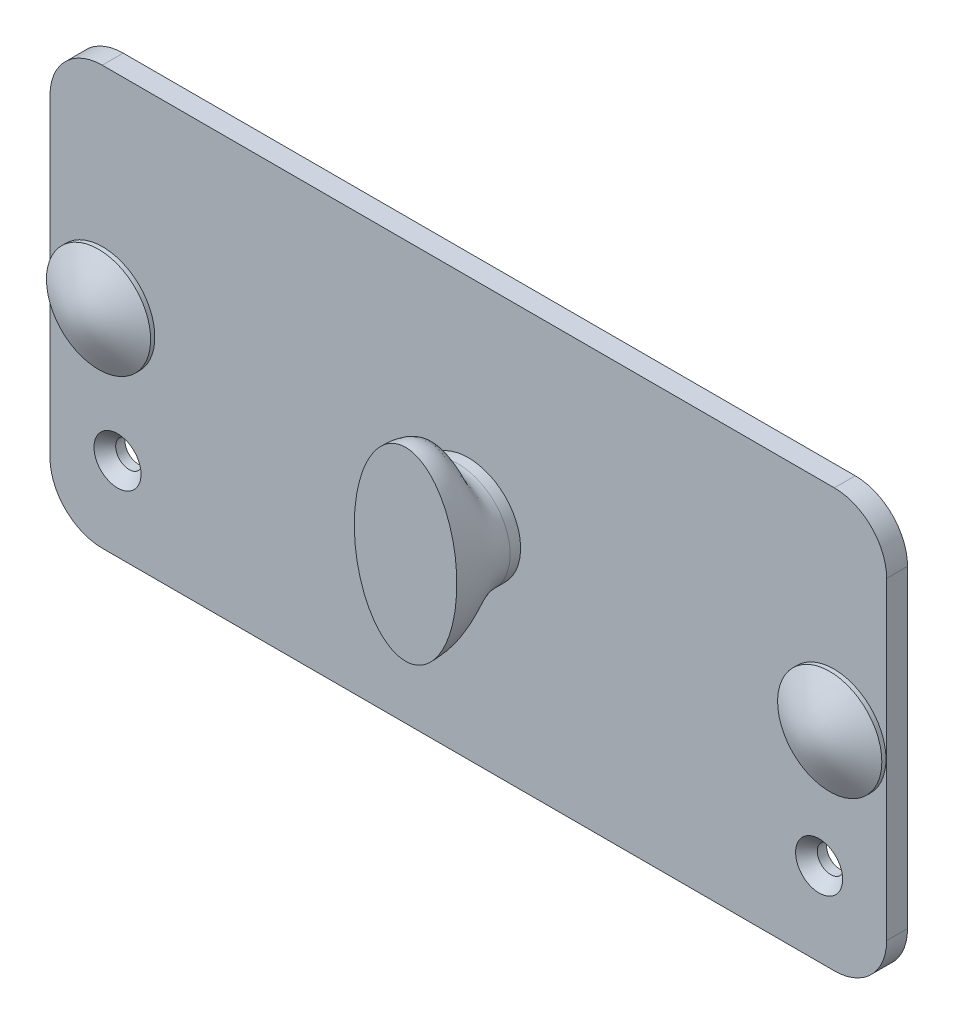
ISO-10303-21;
HEADER;
FILE_DESCRIPTION(('STEP AP214'),'2;1');
FILE_NAME('part.step','',(''),(''),'','','');
FILE_SCHEMA(('AUTOMOTIVE_DESIGN { 1 0 10303 214 1 1 1 1 }'));
ENDSEC;
DATA;
#1=APPLICATION_CONTEXT('core data for automotive mechanical design processes');
#2=APPLICATION_PROTOCOL_DEFINITION('international standard','automotive_design',2000,#1);
#3=PRODUCT_CONTEXT('',#1,'mechanical');
#4=PRODUCT('Part','Part','',(#3));
#5=PRODUCT_RELATED_PRODUCT_CATEGORY('part','',(#4));
#6=PRODUCT_DEFINITION_FORMATION('','',#4);
#7=PRODUCT_DEFINITION_CONTEXT('part definition',#1,'design');
#8=PRODUCT_DEFINITION('design','',#6,#7);
#9=PRODUCT_DEFINITION_SHAPE('','',#8);
#10=(LENGTH_UNIT() NAMED_UNIT(*) SI_UNIT(.MILLI.,.METRE.));
#11=(NAMED_UNIT(*) PLANE_ANGLE_UNIT() SI_UNIT($,.RADIAN.));
#12=(NAMED_UNIT(*) SI_UNIT($,.STERADIAN.) SOLID_ANGLE_UNIT());
#13=UNCERTAINTY_MEASURE_WITH_UNIT(LENGTH_MEASURE(1.E-05),#10,'distance_accuracy_value','');
#14=(GEOMETRIC_REPRESENTATION_CONTEXT(3) GLOBAL_UNCERTAINTY_ASSIGNED_CONTEXT((#13)) GLOBAL_UNIT_ASSIGNED_CONTEXT((#10,
#11,#12)) REPRESENTATION_CONTEXT('',''));
#15=CARTESIAN_POINT('',(0.,0.,0.));
#16=DIRECTION('',(0.,0.,1.));
#17=DIRECTION('',(1.,0.,0.));
#18=AXIS2_PLACEMENT_3D('',#15,#16,#17);
#19=CARTESIAN_POINT('',(6.35,44.45,2.54));
#20=DIRECTION('',(0.,0.,-1.));
#21=DIRECTION('',(-1.,0.,0.));
#22=AXIS2_PLACEMENT_3D('',#19,#20,#21);
#23=CYLINDRICAL_SURFACE('',#22,6.35);
#24=CARTESIAN_POINT('',(6.35,44.45,0.));
#25=DIRECTION('',(0.,0.,1.));
#26=DIRECTION('',(-1.,0.,0.));
#27=AXIS2_PLACEMENT_3D('',#24,#25,#26);
#28=CIRCLE('',#27,6.35);
#29=CARTESIAN_POINT('',(6.35000000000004,50.8,0.));
#30=VERTEX_POINT('',#29);
#31=CARTESIAN_POINT('',(0.,44.45,0.));
#32=VERTEX_POINT('',#31);
#33=EDGE_CURVE('E222',#30,#32,#28,.T.);
#34=ORIENTED_EDGE('',*,*,#33,.T.);
#35=DIRECTION('',(0.,0.,-1.));
#36=VECTOR('',#35,1.);
#37=CARTESIAN_POINT('',(0.,44.45,2.54));
#38=LINE('',#37,#36);
#39=CARTESIAN_POINT('',(0.,44.45,2.54));
#40=VERTEX_POINT('',#39);
#41=EDGE_CURVE('E250',#40,#32,#38,.T.);
#42=ORIENTED_EDGE('',*,*,#41,.F.);
#43=CARTESIAN_POINT('',(6.35,44.45,2.54));
#44=DIRECTION('',(0.,0.,1.));
#45=DIRECTION('',(-1.,0.,0.));
#46=AXIS2_PLACEMENT_3D('',#43,#44,#45);
#47=CIRCLE('',#46,6.35);
#48=CARTESIAN_POINT('',(6.35000000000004,50.8,2.54));
#49=VERTEX_POINT('',#48);
#50=EDGE_CURVE('E237',#49,#40,#47,.T.);
#51=ORIENTED_EDGE('',*,*,#50,.F.);
#52=DIRECTION('',(0.,0.,-1.));
#53=VECTOR('',#52,1.);
#54=CARTESIAN_POINT('',(6.35000000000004,50.8,2.54));
#55=LINE('',#54,#53);
#56=EDGE_CURVE('E218',#49,#30,#55,.T.);
#57=ORIENTED_EDGE('',*,*,#56,.T.);
#58=EDGE_LOOP('',(#34,#42,#51,#57));
#59=FACE_BOUND('',#58,.T.);
#60=ADVANCED_FACE('F115',(#59),#23,.T.);
#61=CARTESIAN_POINT('',(0.,6.35000000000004,2.54));
#62=DIRECTION('',(1.,0.,0.));
#63=DIRECTION('',(0.,0.,-1.));
#64=AXIS2_PLACEMENT_3D('',#61,#62,#63);
#65=PLANE('',#64);
#66=DIRECTION('',(0.,-1.,0.));
#67=VECTOR('',#66,1.);
#68=CARTESIAN_POINT('',(0.,6.35000000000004,0.));
#69=LINE('',#68,#67);
#70=CARTESIAN_POINT('',(0.,6.35000000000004,0.));
#71=VERTEX_POINT('',#70);
#72=EDGE_CURVE('E225',#32,#71,#69,.T.);
#73=ORIENTED_EDGE('',*,*,#72,.T.);
#74=DIRECTION('',(0.,0.,-1.));
#75=VECTOR('',#74,1.);
#76=CARTESIAN_POINT('',(0.,6.35000000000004,2.54));
#77=LINE('',#76,#75);
#78=CARTESIAN_POINT('',(0.,6.35000000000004,2.54));
#79=VERTEX_POINT('',#78);
#80=EDGE_CURVE('E247',#79,#71,#77,.T.);
#81=ORIENTED_EDGE('',*,*,#80,.F.);
#82=DIRECTION('',(0.,-1.,0.));
#83=VECTOR('',#82,1.);
#84=CARTESIAN_POINT('',(0.,6.35000000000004,2.54));
#85=LINE('',#84,#83);
#86=EDGE_CURVE('E185',#40,#79,#85,.T.);
#87=ORIENTED_EDGE('',*,*,#86,.F.);
#88=ORIENTED_EDGE('',*,*,#41,.T.);
#89=EDGE_LOOP('',(#73,#81,#87,#88));
#90=FACE_BOUND('',#89,.T.);
#91=ADVANCED_FACE('F302',(#90),#65,.F.);
#92=CARTESIAN_POINT('',(6.35,6.35,2.54));
#93=DIRECTION('',(0.,0.,-1.));
#94=DIRECTION('',(-1.,0.,0.));
#95=AXIS2_PLACEMENT_3D('',#92,#93,#94);
#96=CYLINDRICAL_SURFACE('',#95,6.35);
#97=CARTESIAN_POINT('',(6.35,6.35,0.));
#98=DIRECTION('',(0.,0.,1.));
#99=DIRECTION('',(-1.,0.,0.));
#100=AXIS2_PLACEMENT_3D('',#97,#98,#99);
#101=CIRCLE('',#100,6.35);
#102=CARTESIAN_POINT('',(6.35000000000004,0.,0.));
#103=VERTEX_POINT('',#102);
#104=EDGE_CURVE('E228',#71,#103,#101,.T.);
#105=ORIENTED_EDGE('',*,*,#104,.T.);
#106=DIRECTION('',(0.,0.,-1.));
#107=VECTOR('',#106,1.);
#108=CARTESIAN_POINT('',(6.35000000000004,0.,2.54));
#109=LINE('',#108,#107);
#110=CARTESIAN_POINT('',(6.35000000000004,0.,2.54));
#111=VERTEX_POINT('',#110);
#112=EDGE_CURVE('E244',#111,#103,#109,.T.);
#113=ORIENTED_EDGE('',*,*,#112,.F.);
#114=CARTESIAN_POINT('',(6.35,6.35,2.54));
#115=DIRECTION('',(0.,0.,1.));
#116=DIRECTION('',(-1.,0.,0.));
#117=AXIS2_PLACEMENT_3D('',#114,#115,#116);
#118=CIRCLE('',#117,6.35);
#119=EDGE_CURVE('E372',#79,#111,#118,.T.);
#120=ORIENTED_EDGE('',*,*,#119,.F.);
#121=ORIENTED_EDGE('',*,*,#80,.T.);
#122=EDGE_LOOP('',(#105,#113,#120,#121));
#123=FACE_BOUND('',#122,.T.);
#124=ADVANCED_FACE('F298',(#123),#96,.T.);
#125=CARTESIAN_POINT('',(6.35000000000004,0.,2.54));
#126=DIRECTION('',(0.,1.,0.));
#127=DIRECTION('',(0.,0.,1.));
#128=AXIS2_PLACEMENT_3D('',#125,#126,#127);
#129=PLANE('',#128);
#130=DIRECTION('',(1.,0.,0.));
#131=VECTOR('',#130,1.);
#132=CARTESIAN_POINT('',(6.35000000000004,0.,0.));
#133=LINE('',#132,#131);
#134=CARTESIAN_POINT('',(95.2499999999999,0.,0.));
#135=VERTEX_POINT('',#134);
#136=EDGE_CURVE('E230',#103,#135,#133,.T.);
#137=ORIENTED_EDGE('',*,*,#136,.T.);
#138=DIRECTION('',(0.,0.,-1.));
#139=VECTOR('',#138,1.);
#140=CARTESIAN_POINT('',(95.2499999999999,0.,2.54));
#141=LINE('',#140,#139);
#142=CARTESIAN_POINT('',(95.2499999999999,0.,2.54));
#143=VERTEX_POINT('',#142);
#144=EDGE_CURVE('E241',#143,#135,#141,.T.);
#145=ORIENTED_EDGE('',*,*,#144,.F.);
#146=DIRECTION('',(1.,0.,0.));
#147=VECTOR('',#146,1.);
#148=CARTESIAN_POINT('',(6.35000000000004,0.,2.54));
#149=LINE('',#148,#147);
#150=EDGE_CURVE('E374',#111,#143,#149,.T.);
#151=ORIENTED_EDGE('',*,*,#150,.F.);
#152=ORIENTED_EDGE('',*,*,#112,.T.);
#153=EDGE_LOOP('',(#137,#145,#151,#152));
#154=FACE_BOUND('',#153,.T.);
#155=ADVANCED_FACE('F294',(#154),#129,.F.);
#156=CARTESIAN_POINT('',(95.25,6.35,2.54));
#157=DIRECTION('',(0.,0.,-1.));
#158=DIRECTION('',(-1.,0.,0.));
#159=AXIS2_PLACEMENT_3D('',#156,#157,#158);
#160=CYLINDRICAL_SURFACE('',#159,6.35);
#161=CARTESIAN_POINT('',(95.25,6.35,0.));
#162=DIRECTION('',(0.,0.,1.));
#163=DIRECTION('',(1.,0.,0.));
#164=AXIS2_PLACEMENT_3D('',#161,#162,#163);
#165=CIRCLE('',#164,6.35);
#166=CARTESIAN_POINT('',(101.6,6.35,0.));
#167=VERTEX_POINT('',#166);
#168=EDGE_CURVE('E232',#135,#167,#165,.T.);
#169=ORIENTED_EDGE('',*,*,#168,.T.);
#170=DIRECTION('',(0.,0.,-1.));
#171=VECTOR('',#170,1.);
#172=CARTESIAN_POINT('',(101.6,6.35,2.54));
#173=LINE('',#172,#171);
#174=CARTESIAN_POINT('',(101.6,6.35,2.54));
#175=VERTEX_POINT('',#174);
#176=EDGE_CURVE('E213',#175,#167,#173,.T.);
#177=ORIENTED_EDGE('',*,*,#176,.F.);
#178=CARTESIAN_POINT('',(95.25,6.35,2.54));
#179=DIRECTION('',(0.,0.,1.));
#180=DIRECTION('',(1.,0.,0.));
#181=AXIS2_PLACEMENT_3D('',#178,#179,#180);
#182=CIRCLE('',#181,6.35);
#183=EDGE_CURVE('E204',#143,#175,#182,.T.);
#184=ORIENTED_EDGE('',*,*,#183,.F.);
#185=ORIENTED_EDGE('',*,*,#144,.T.);
#186=EDGE_LOOP('',(#169,#177,#184,#185));
#187=FACE_BOUND('',#186,.T.);
#188=ADVANCED_FACE('F291',(#187),#160,.T.);
#189=CARTESIAN_POINT('',(101.6,6.35000000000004,2.54));
#190=DIRECTION('',(-1.,0.,0.));
#191=DIRECTION('',(0.,0.,1.));
#192=AXIS2_PLACEMENT_3D('',#189,#190,#191);
#193=PLANE('',#192);
#194=DIRECTION('',(0.,1.,0.));
#195=VECTOR('',#194,1.);
#196=CARTESIAN_POINT('',(101.6,6.35000000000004,0.));
#197=LINE('',#196,#195);
#198=CARTESIAN_POINT('',(101.6,44.45,0.));
#199=VERTEX_POINT('',#198);
#200=EDGE_CURVE('E212',#167,#199,#197,.T.);
#201=ORIENTED_EDGE('',*,*,#200,.T.);
#202=DIRECTION('',(0.,0.,-1.));
#203=VECTOR('',#202,1.);
#204=CARTESIAN_POINT('',(101.6,44.45,2.54));
#205=LINE('',#204,#203);
#206=CARTESIAN_POINT('',(101.6,44.45,2.54));
#207=VERTEX_POINT('',#206);
#208=EDGE_CURVE('E209',#207,#199,#205,.T.);
#209=ORIENTED_EDGE('',*,*,#208,.F.);
#210=DIRECTION('',(0.,1.,0.));
#211=VECTOR('',#210,1.);
#212=CARTESIAN_POINT('',(101.6,6.35000000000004,2.54));
#213=LINE('',#212,#211);
#214=EDGE_CURVE('E198',#175,#207,#213,.T.);
#215=ORIENTED_EDGE('',*,*,#214,.F.);
#216=ORIENTED_EDGE('',*,*,#176,.T.);
#217=EDGE_LOOP('',(#201,#209,#215,#216));
#218=FACE_BOUND('',#217,.T.);
#219=ADVANCED_FACE('F210',(#218),#193,.F.);
#220=CARTESIAN_POINT('',(95.25,44.45,2.54));
#221=DIRECTION('',(0.,0.,-1.));
#222=DIRECTION('',(-1.,0.,0.));
#223=AXIS2_PLACEMENT_3D('',#220,#221,#222);
#224=CYLINDRICAL_SURFACE('',#223,6.34999999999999);
#225=CARTESIAN_POINT('',(95.25,44.45,0.));
#226=DIRECTION('',(0.,0.,1.));
#227=DIRECTION('',(-1.,0.,0.));
#228=AXIS2_PLACEMENT_3D('',#225,#226,#227);
#229=CIRCLE('',#228,6.34999999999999);
#230=CARTESIAN_POINT('',(95.2499999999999,50.8,0.));
#231=VERTEX_POINT('',#230);
#232=EDGE_CURVE('E170',#199,#231,#229,.T.);
#233=ORIENTED_EDGE('',*,*,#232,.T.);
#234=DIRECTION('',(0.,0.,-1.));
#235=VECTOR('',#234,1.);
#236=CARTESIAN_POINT('',(95.2499999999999,50.8,2.54));
#237=LINE('',#236,#235);
#238=CARTESIAN_POINT('',(95.2499999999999,50.8,2.54));
#239=VERTEX_POINT('',#238);
#240=EDGE_CURVE('E214',#239,#231,#237,.T.);
#241=ORIENTED_EDGE('',*,*,#240,.F.);
#242=CARTESIAN_POINT('',(95.25,44.45,2.54));
#243=DIRECTION('',(0.,0.,1.));
#244=DIRECTION('',(-1.,0.,0.));
#245=AXIS2_PLACEMENT_3D('',#242,#243,#244);
#246=CIRCLE('',#245,6.34999999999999);
#247=EDGE_CURVE('E202',#207,#239,#246,.T.);
#248=ORIENTED_EDGE('',*,*,#247,.F.);
#249=ORIENTED_EDGE('',*,*,#208,.T.);
#250=EDGE_LOOP('',(#233,#241,#248,#249));
#251=FACE_BOUND('',#250,.T.);
#252=ADVANCED_FACE('F216',(#251),#224,.T.);
#253=CARTESIAN_POINT('',(6.35000000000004,50.8,2.54));
#254=DIRECTION('',(0.,-1.,0.));
#255=DIRECTION('',(0.,0.,-1.));
#256=AXIS2_PLACEMENT_3D('',#253,#254,#255);
#257=PLANE('',#256);
#258=DIRECTION('',(-1.,0.,0.));
#259=VECTOR('',#258,1.);
#260=CARTESIAN_POINT('',(6.35000000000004,50.8,0.));
#261=LINE('',#260,#259);
#262=EDGE_CURVE('E176',#231,#30,#261,.T.);
#263=ORIENTED_EDGE('',*,*,#262,.T.);
#264=ORIENTED_EDGE('',*,*,#56,.F.);
#265=DIRECTION('',(-1.,0.,0.));
#266=VECTOR('',#265,1.);
#267=CARTESIAN_POINT('',(6.35000000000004,50.8,2.54));
#268=LINE('',#267,#266);
#269=EDGE_CURVE('E141',#239,#49,#268,.T.);
#270=ORIENTED_EDGE('',*,*,#269,.F.);
#271=ORIENTED_EDGE('',*,*,#240,.T.);
#272=EDGE_LOOP('',(#263,#264,#270,#271));
#273=FACE_BOUND('',#272,.T.);
#274=ADVANCED_FACE('F280',(#273),#257,.F.);
#275=CARTESIAN_POINT('',(6.35,44.45,2.54));
#276=DIRECTION('',(0.,0.,-1.));
#277=DIRECTION('',(-1.,0.,0.));
#278=AXIS2_PLACEMENT_3D('',#275,#276,#277);
#279=PLANE('',#278);
#280=CARTESIAN_POINT('',(8.2,10.1217907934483,2.54));
#281=DIRECTION('',(0.,0.,1.));
#282=DIRECTION('',(1.,0.,0.));
#283=AXIS2_PLACEMENT_3D('',#280,#281,#282);
#284=CIRCLE('',#283,2.8575);
#285=CARTESIAN_POINT('',(11.0575,10.1217907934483,2.54));
#286=VERTEX_POINT('',#285);
#287=EDGE_CURVE('E544',#286,#286,#284,.T.);
#288=ORIENTED_EDGE('',*,*,#287,.F.);
#289=EDGE_LOOP('',(#288));
#290=FACE_BOUND('',#289,.T.);
#291=CARTESIAN_POINT('',(93.4,10.1217907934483,2.54));
#292=DIRECTION('',(0.,0.,1.));
#293=DIRECTION('',(1.,0.,0.));
#294=AXIS2_PLACEMENT_3D('',#291,#292,#293);
#295=CIRCLE('',#294,2.8575);
#296=CARTESIAN_POINT('',(96.2575,10.1217907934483,2.54));
#297=VERTEX_POINT('',#296);
#298=EDGE_CURVE('E551',#297,#297,#295,.T.);
#299=ORIENTED_EDGE('',*,*,#298,.F.);
#300=EDGE_LOOP('',(#299));
#301=FACE_BOUND('',#300,.T.);
#302=CARTESIAN_POINT('',(95.1960603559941,25.4,2.54));
#303=DIRECTION('',(0.,0.,-1.));
#304=DIRECTION('',(-1.,0.,0.));
#305=AXIS2_PLACEMENT_3D('',#302,#303,#304);
#306=CIRCLE('',#305,6.3257863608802);
#307=CARTESIAN_POINT('',(88.8702739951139,25.4,2.54));
#308=VERTEX_POINT('',#307);
#309=EDGE_CURVE('E13',#308,#308,#306,.F.);
#310=ORIENTED_EDGE('',*,*,#309,.F.);
#311=EDGE_LOOP('',(#310));
#312=FACE_BOUND('',#311,.T.);
#313=CARTESIAN_POINT('',(6.40393964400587,25.4,2.54));
#314=DIRECTION('',(0.,0.,-1.));
#315=DIRECTION('',(-1.,0.,0.));
#316=AXIS2_PLACEMENT_3D('',#313,#314,#315);
#317=CIRCLE('',#316,6.32578636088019);
#318=CARTESIAN_POINT('',(0.0781532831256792,25.4,2.54));
#319=VERTEX_POINT('',#318);
#320=EDGE_CURVE('E132',#319,#319,#317,.F.);
#321=ORIENTED_EDGE('',*,*,#320,.F.);
#322=EDGE_LOOP('',(#321));
#323=FACE_BOUND('',#322,.T.);
#324=CARTESIAN_POINT('',(50.8,25.4,2.54));
#325=DIRECTION('',(0.,0.,-1.));
#326=DIRECTION('',(-1.,0.,0.));
#327=AXIS2_PLACEMENT_3D('',#324,#325,#326);
#328=CIRCLE('',#327,6.35);
#329=CARTESIAN_POINT('',(44.45,25.4,2.54));
#330=VERTEX_POINT('',#329);
#331=EDGE_CURVE('E252',#330,#330,#328,.F.);
#332=ORIENTED_EDGE('',*,*,#331,.F.);
#333=EDGE_LOOP('',(#332));
#334=FACE_BOUND('',#333,.T.);
#335=ORIENTED_EDGE('',*,*,#50,.T.);
#336=ORIENTED_EDGE('',*,*,#86,.T.);
#337=ORIENTED_EDGE('',*,*,#119,.T.);
#338=ORIENTED_EDGE('',*,*,#150,.T.);
#339=ORIENTED_EDGE('',*,*,#183,.T.);
#340=ORIENTED_EDGE('',*,*,#214,.T.);
#341=ORIENTED_EDGE('',*,*,#247,.T.);
#342=ORIENTED_EDGE('',*,*,#269,.T.);
#343=EDGE_LOOP('',(#335,#336,#337,#338,#339,#340,#341,#342));
#344=FACE_BOUND('',#343,.T.);
#345=ADVANCED_FACE('F200',(#290,#301,#312,#323,#334,#344),#279,.F.);
#346=CARTESIAN_POINT('',(6.35,44.45,0.));
#347=DIRECTION('',(0.,0.,-1.));
#348=DIRECTION('',(-1.,0.,0.));
#349=AXIS2_PLACEMENT_3D('',#346,#347,#348);
#350=PLANE('',#349);
#351=CARTESIAN_POINT('',(8.2,10.1217907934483,0.));
#352=DIRECTION('',(0.,0.,1.));
#353=DIRECTION('',(1.,0.,0.));
#354=AXIS2_PLACEMENT_3D('',#351,#352,#353);
#355=CIRCLE('',#354,1.63194999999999);
#356=CARTESIAN_POINT('',(9.83194999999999,10.1217907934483,0.));
#357=VERTEX_POINT('',#356);
#358=EDGE_CURVE('E546',#357,#357,#355,.T.);
#359=ORIENTED_EDGE('',*,*,#358,.T.);
#360=EDGE_LOOP('',(#359));
#361=FACE_BOUND('',#360,.T.);
#362=CARTESIAN_POINT('',(93.4,10.1217907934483,0.));
#363=DIRECTION('',(0.,0.,1.));
#364=DIRECTION('',(1.,0.,0.));
#365=AXIS2_PLACEMENT_3D('',#362,#363,#364);
#366=CIRCLE('',#365,1.63194999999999);
#367=CARTESIAN_POINT('',(95.03195,10.1217907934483,0.));
#368=VERTEX_POINT('',#367);
#369=EDGE_CURVE('E327',#368,#368,#366,.T.);
#370=ORIENTED_EDGE('',*,*,#369,.T.);
#371=EDGE_LOOP('',(#370));
#372=FACE_BOUND('',#371,.T.);
#373=ORIENTED_EDGE('',*,*,#33,.F.);
#374=ORIENTED_EDGE('',*,*,#262,.F.);
#375=ORIENTED_EDGE('',*,*,#232,.F.);
#376=ORIENTED_EDGE('',*,*,#200,.F.);
#377=ORIENTED_EDGE('',*,*,#168,.F.);
#378=ORIENTED_EDGE('',*,*,#136,.F.);
#379=ORIENTED_EDGE('',*,*,#104,.F.);
#380=ORIENTED_EDGE('',*,*,#72,.F.);
#381=EDGE_LOOP('',(#373,#374,#375,#376,#377,#378,#379,#380));
#382=FACE_BOUND('',#381,.T.);
#383=ADVANCED_FACE('F274',(#361,#372,#382),#350,.T.);
#384=CARTESIAN_POINT('',(50.8,25.4,3.81));
#385=DIRECTION('',(0.,0.,-1.));
#386=DIRECTION('',(-1.,0.,0.));
#387=AXIS2_PLACEMENT_3D('',#384,#385,#386);
#388=CYLINDRICAL_SURFACE('',#387,6.35);
#389=CARTESIAN_POINT('',(49.9920172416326,31.6983858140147,3.81));
#390=CARTESIAN_POINT('',(49.5797888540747,31.6455034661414,3.81));
#391=CARTESIAN_POINT('',(49.0711150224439,31.5282284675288,3.81));
#392=CARTESIAN_POINT('',(48.4849312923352,31.3154636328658,3.81));
#393=CARTESIAN_POINT('',(48.1973983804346,31.1949102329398,3.81));
#394=CARTESIAN_POINT('',(47.9161384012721,31.0604218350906,3.81));
#395=CARTESIAN_POINT('',(47.5504409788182,30.8628386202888,3.81));
#396=CARTESIAN_POINT('',(47.1125714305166,30.5822020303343,3.81));
#397=CARTESIAN_POINT('',(46.6224957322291,30.1955797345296,3.81));
#398=CARTESIAN_POINT('',(46.1723519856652,29.7630927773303,3.81));
#399=CARTESIAN_POINT('',(45.7667031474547,29.288734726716,3.81));
#400=CARTESIAN_POINT('',(45.4101121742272,28.7764991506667,3.81));
#401=CARTESIAN_POINT('',(45.0036617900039,28.0502225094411,3.81));
#402=CARTESIAN_POINT('',(44.6317200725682,27.0747109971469,3.81));
#403=CARTESIAN_POINT('',(44.424746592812,25.8390770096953,3.81));
#404=CARTESIAN_POINT('',(44.4604133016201,24.5867212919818,3.81000000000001));
#405=CARTESIAN_POINT('',(44.7420038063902,23.3659422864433,3.81));
#406=CARTESIAN_POINT('',(45.168805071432,22.4131433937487,3.81));
#407=CARTESIAN_POINT('',(45.6178551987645,21.7125362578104,3.81));
#408=CARTESIAN_POINT('',(46.0044700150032,21.2224581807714,3.81));
#409=CARTESIAN_POINT('',(46.436934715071,20.772318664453,3.81));
#410=CARTESIAN_POINT('',(46.8322157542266,20.4342856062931,3.81));
#411=CARTESIAN_POINT('',(47.1673881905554,20.1883897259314,3.81));
#412=CARTESIAN_POINT('',(47.4275647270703,20.0165696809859,3.81));
#413=CARTESIAN_POINT('',(47.6958618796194,19.8576880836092,3.81));
#414=CARTESIAN_POINT('',(47.9716030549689,19.7120815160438,3.81));
#415=CARTESIAN_POINT('',(48.2541116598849,19.5800865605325,3.81));
#416=CARTESIAN_POINT('',(48.5427111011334,19.4620397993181,3.81));
#417=CARTESIAN_POINT('',(48.8367247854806,19.3582778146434,3.81));
#418=CARTESIAN_POINT('',(49.1354761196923,19.269137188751,3.81));
#419=CARTESIAN_POINT('',(49.4382885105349,19.1949545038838,3.81));
#420=CARTESIAN_POINT('',(49.7444078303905,19.1357814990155,3.81));
#421=CARTESIAN_POINT('',(50.0530799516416,19.0916699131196,3.81));
#422=CARTESIAN_POINT('',(50.3635507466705,19.0626714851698,3.81));
#423=CARTESIAN_POINT('',(50.6750660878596,19.0488379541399,3.81));
#424=CARTESIAN_POINT('',(50.9868718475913,19.0502210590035,3.81));
#425=CARTESIAN_POINT('',(51.2982138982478,19.0668725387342,3.81));
#426=CARTESIAN_POINT('',(51.6083381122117,19.0988441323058,3.81));
#427=CARTESIAN_POINT('',(51.9164903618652,19.1461875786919,3.81));
#428=CARTESIAN_POINT('',(52.2219539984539,19.2086624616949,3.81));
#429=CARTESIAN_POINT('',(52.5240123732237,19.2860283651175,3.81));
#430=CARTESIAN_POINT('',(52.8219488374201,19.3780448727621,3.81));
#431=CARTESIAN_POINT('',(53.1150467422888,19.4844715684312,3.81));
#432=CARTESIAN_POINT('',(53.4025894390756,19.6050680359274,3.81));
#433=CARTESIAN_POINT('',(53.683860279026,19.7395938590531,3.81));
#434=CARTESIAN_POINT('',(53.9581426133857,19.8878086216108,3.81));
#435=CARTESIAN_POINT('',(54.2247197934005,20.0494719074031,3.81));
#436=CARTESIAN_POINT('',(54.4830220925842,20.2240872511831,3.81));
#437=CARTESIAN_POINT('',(54.7324797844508,20.4111581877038,3.81));
#438=CARTESIAN_POINT('',(55.0525375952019,20.6765316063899,3.81));
#439=CARTESIAN_POINT('',(55.4276497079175,21.036905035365,3.81));
#440=CARTESIAN_POINT('',(55.8332901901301,21.5112320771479,3.81));
#441=CARTESIAN_POINT('',(56.1898788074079,22.0234663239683,3.81));
#442=CARTESIAN_POINT('',(56.5963315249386,22.7497648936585,3.81));
#443=CARTESIAN_POINT('',(56.9682816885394,23.7253184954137,3.81));
#444=CARTESIAN_POINT('',(57.1752589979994,24.9609312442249,3.81));
#445=CARTESIAN_POINT('',(57.1395893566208,26.2132579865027,3.81));
#446=CARTESIAN_POINT('',(56.8579887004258,27.4340642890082,3.81));
#447=CARTESIAN_POINT('',(56.4311860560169,28.3868811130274,3.80999999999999));
#448=CARTESIAN_POINT('',(55.9821469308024,29.0874686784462,3.80999999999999));
#449=CARTESIAN_POINT('',(55.5955415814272,29.5775261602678,3.81));
#450=CARTESIAN_POINT('',(55.1630827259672,30.0276502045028,3.81));
#451=CARTESIAN_POINT('',(54.767799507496,30.3656838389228,3.81));
#452=CARTESIAN_POINT('',(54.4326186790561,30.6115937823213,3.81));
#453=CARTESIAN_POINT('',(54.1724338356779,30.7834286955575,3.81));
#454=CARTESIAN_POINT('',(53.9041276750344,30.9423270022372,3.81));
#455=CARTESIAN_POINT('',(53.6283781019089,31.0879496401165,3.81));
#456=CARTESIAN_POINT('',(53.3458630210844,31.2199575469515,3.81));
#457=CARTESIAN_POINT('',(53.0572603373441,31.3380116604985,3.81));
#458=CARTESIAN_POINT('',(52.7632479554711,31.4417729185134,3.81));
#459=CARTESIAN_POINT('',(52.4645037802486,31.5309022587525,3.81));
#460=CARTESIAN_POINT('',(52.1617057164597,31.6050606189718,3.81));
#461=CARTESIAN_POINT('',(51.8556047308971,31.6641999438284,3.81));
#462=CARTESIAN_POINT('',(51.5469517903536,31.7082721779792,3.81));
#463=CARTESIAN_POINT('',(51.2365028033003,31.7372299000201,3.81));
#464=CARTESIAN_POINT('',(50.925013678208,31.7510256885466,3.81));
#465=CARTESIAN_POINT('',(50.6132180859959,31.7496092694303,3.81));
#466=CARTESIAN_POINT('',(50.3018496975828,31.7329303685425,3.81));
#467=CARTESIAN_POINT('',(50.0950743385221,31.711606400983,3.81));
#468=CARTESIAN_POINT('',(49.9920172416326,31.6983858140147,3.81));
#469=B_SPLINE_CURVE_WITH_KNOTS('',3,(#389,#390,#391,#392,#393,#394,#395,#396,#397,#398,#399,
#400,#401,#402,#403,#404,#405,#406,#407,#408,#409,#410,#411,#412,#413,#414,#415,#416,#417,#418,
#419,#420,#421,#422,#423,#424,#425,#426,#427,#428,#429,#430,#431,#432,#433,#434,#435,#436,#437,
#438,#439,#440,#441,#442,#443,#444,#445,#446,#447,#448,#449,#450,#451,#452,#453,#454,#455,#456,
#457,#458,#459,#460,#461,#462,#463,#464,#465,#466,#467,#468),.UNSPECIFIED.,.T.,.F.,(4,1,1,1,1,1,
1,1,1,1,1,1,1,1,1,1,1,1,1,1,1,1,1,1,1,1,1,1,1,1,1,1,1,1,1,1,1,1,1,1,1,1,1,1,1,1,1,1,1,1,1,1,1,1,
1,1,1,1,1,1,1,1,1,1,1,1,1,1,1,1,1,1,1,1,1,1,1,4),(0.,0.03125,0.0390625,0.046875,0.0546875,
0.0625,0.078125,0.09375,0.109375,0.125,0.140625,0.15625,0.1875,0.21875,0.25,0.28125,0.3125,
0.328125,0.34375,0.359375,0.375,0.3828125,0.390625,0.3984375,0.40625,0.4140625,0.421875,
0.4296875,0.4375,0.4453125,0.453125,0.4609375,0.46875,0.4765625,0.484375,0.4921875,0.5,
0.5078125,0.515625,0.5234375,0.53125,0.5390625,0.546875,0.5546875,0.5625,0.5703125,0.578125,
0.5859375,0.59375,0.609375,0.625,0.640625,0.65625,0.6875,0.71875,0.75,0.78125,0.8125,0.828125,
0.84375,0.859375,0.875,0.8828125,0.890625,0.8984375,0.90625,0.9140625,0.921875,0.9296875,0.9375,
0.9453125,0.953125,0.9609375,0.96875,0.9765625,0.984375,0.9921875,1.),.UNSPECIFIED.);
#470=CARTESIAN_POINT('',(49.9920172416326,31.6983858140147,3.81));
#471=VERTEX_POINT('',#470);
#472=EDGE_CURVE('E226',#471,#471,#469,.T.);
#473=ORIENTED_EDGE('',*,*,#472,.F.);
#474=EDGE_LOOP('',(#473));
#475=FACE_BOUND('',#474,.T.);
#476=ORIENTED_EDGE('',*,*,#331,.T.);
#477=EDGE_LOOP('',(#476));
#478=FACE_BOUND('',#477,.T.);
#479=ADVANCED_FACE('F263',(#475,#478),#388,.T.);
#480=CARTESIAN_POINT('',(49.9920172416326,31.6983858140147,3.81));
#481=CARTESIAN_POINT('',(49.9920172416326,31.6983858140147,7.27681459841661));
#482=CARTESIAN_POINT('',(49.8535451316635,36.519088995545,4.49590854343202));
#483=CARTESIAN_POINT('',(49.8535451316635,36.519088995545,10.16));
#484=CARTESIAN_POINT('',(49.5797888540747,31.6455034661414,3.81));
#485=CARTESIAN_POINT('',(49.5797888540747,31.6455034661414,7.25980938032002));
#486=CARTESIAN_POINT('',(49.2908650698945,36.3628868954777,4.52368104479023));
#487=CARTESIAN_POINT('',(49.2908650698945,36.3628868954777,10.16));
#488=CARTESIAN_POINT('',(49.0711150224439,31.5282284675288,3.81));
#489=CARTESIAN_POINT('',(49.0711150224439,31.5282284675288,7.22052156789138));
#490=CARTESIAN_POINT('',(48.6401458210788,36.0011974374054,4.58785745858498));
#491=CARTESIAN_POINT('',(48.6401458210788,36.0011974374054,10.16));
#492=CARTESIAN_POINT('',(48.4849312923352,31.3154636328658,3.81));
#493=CARTESIAN_POINT('',(48.4849312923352,31.3154636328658,7.16640969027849));
#494=CARTESIAN_POINT('',(47.9735527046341,35.4332224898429,4.67630980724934));
#495=CARTESIAN_POINT('',(47.9735527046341,35.4332224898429,10.16));
#496=CARTESIAN_POINT('',(48.1973983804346,31.1949102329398,3.81));
#497=CARTESIAN_POINT('',(48.1973983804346,31.1949102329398,7.13855855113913));
#498=CARTESIAN_POINT('',(47.661934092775,35.1258636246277,4.7218418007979));
#499=CARTESIAN_POINT('',(47.661934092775,35.1258636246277,10.16));
#500=CARTESIAN_POINT('',(47.9161384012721,31.0604218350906,3.81));
#501=CARTESIAN_POINT('',(47.9161384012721,31.0604218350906,7.11051031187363));
#502=CARTESIAN_POINT('',(47.3708173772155,34.7985514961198,4.7676533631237));
#503=CARTESIAN_POINT('',(47.3708173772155,34.7985514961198,10.16));
#504=CARTESIAN_POINT('',(47.5504409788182,30.8628386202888,3.81));
#505=CARTESIAN_POINT('',(47.5504409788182,30.8628386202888,7.07364732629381));
#506=CARTESIAN_POINT('',(47.0084295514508,34.3400884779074,4.82781993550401));
#507=CARTESIAN_POINT('',(47.0084295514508,34.3400884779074,10.16));
#508=CARTESIAN_POINT('',(47.1125714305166,30.5822020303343,3.81));
#509=CARTESIAN_POINT('',(47.1125714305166,30.5822020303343,7.0300663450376));
#510=CARTESIAN_POINT('',(46.6008192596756,33.7342171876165,4.8990793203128));
#511=CARTESIAN_POINT('',(46.6008192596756,33.7342171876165,10.16));
#512=CARTESIAN_POINT('',(46.6224957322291,30.1955797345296,3.81));
#513=CARTESIAN_POINT('',(46.6224957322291,30.1955797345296,6.98307420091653));
#514=CARTESIAN_POINT('',(46.1776686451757,32.9663420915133,4.97579992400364));
#515=CARTESIAN_POINT('',(46.1776686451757,32.9663420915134,10.16));
#516=CARTESIAN_POINT('',(46.1723519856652,29.7630927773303,3.81));
#517=CARTESIAN_POINT('',(46.1723519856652,29.7630927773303,6.94269572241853));
#518=CARTESIAN_POINT('',(45.8138823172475,32.1692759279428,5.04185015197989));
#519=CARTESIAN_POINT('',(45.8138823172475,32.1692759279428,10.16));
#520=CARTESIAN_POINT('',(45.7667031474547,29.288734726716,3.81));
#521=CARTESIAN_POINT('',(45.7667031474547,29.288734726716,6.90892937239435));
#522=CARTESIAN_POINT('',(45.5041259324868,31.349428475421,5.09694911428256));
#523=CARTESIAN_POINT('',(45.5041259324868,31.349428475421,10.16));
#524=CARTESIAN_POINT('',(45.4101121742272,28.7764991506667,3.81));
#525=CARTESIAN_POINT('',(45.4101121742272,28.7764991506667,6.8817736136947));
#526=CARTESIAN_POINT('',(45.2430651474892,30.513209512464,5.14131576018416));
#527=CARTESIAN_POINT('',(45.2430651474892,30.513209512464,10.16));
#528=CARTESIAN_POINT('',(45.0036617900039,28.0502225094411,3.81));
#529=CARTESIAN_POINT('',(45.0036617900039,28.0502225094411,6.85333319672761));
#530=CARTESIAN_POINT('',(44.9561431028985,29.380877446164,5.18780050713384));
#531=CARTESIAN_POINT('',(44.9561431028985,29.380877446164,10.16));
#532=CARTESIAN_POINT('',(44.6317200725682,27.0747109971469,3.81));
#533=CARTESIAN_POINT('',(44.6317200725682,27.0747109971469,6.830383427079));
#534=CARTESIAN_POINT('',(44.7050978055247,27.9412407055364,5.22528662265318));
#535=CARTESIAN_POINT('',(44.7050978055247,27.9412407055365,10.16));
#536=CARTESIAN_POINT('',(44.424746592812,25.8390770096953,3.81));
#537=CARTESIAN_POINT('',(44.424746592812,25.8390770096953,6.81704782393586));
#538=CARTESIAN_POINT('',(44.5609094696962,26.1940127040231,5.24707778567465));
#539=CARTESIAN_POINT('',(44.5609094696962,26.1940127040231,10.16));
#540=CARTESIAN_POINT('',(44.4604133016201,24.5867212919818,3.81000000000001));
#541=CARTESIAN_POINT('',(44.4604133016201,24.5867212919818,6.81444529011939));
#542=CARTESIAN_POINT('',(44.56807065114,24.4408041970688,5.25132728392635));
#543=CARTESIAN_POINT('',(44.56807065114,24.4408041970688,10.16));
#544=CARTESIAN_POINT('',(44.7420038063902,23.3659422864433,3.81));
#545=CARTESIAN_POINT('',(44.7420038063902,23.3659422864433,6.823321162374));
#546=CARTESIAN_POINT('',(44.7265253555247,22.694790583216,5.23683255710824));
#547=CARTESIAN_POINT('',(44.7265253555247,22.694790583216,10.16));
#548=CARTESIAN_POINT('',(45.168805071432,22.4131433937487,3.81));
#549=CARTESIAN_POINT('',(45.168805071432,22.4131433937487,6.84415983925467));
#550=CARTESIAN_POINT('',(44.9906910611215,21.2575230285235,5.2027660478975));
#551=CARTESIAN_POINT('',(44.9906910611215,21.2575230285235,10.16));
#552=CARTESIAN_POINT('',(45.6178551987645,21.7125362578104,3.81));
#553=CARTESIAN_POINT('',(45.6178551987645,21.7125362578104,6.87248913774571));
#554=CARTESIAN_POINT('',(45.2885770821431,20.1279949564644,5.15652269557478));
#555=CARTESIAN_POINT('',(45.2885770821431,20.1279949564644,10.16));
#556=CARTESIAN_POINT('',(46.0044700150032,21.2224581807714,3.81));
#557=CARTESIAN_POINT('',(46.0044700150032,21.2224581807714,6.90028324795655));
#558=CARTESIAN_POINT('',(45.5585398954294,19.2946072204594,5.11107149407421));
#559=CARTESIAN_POINT('',(45.5585398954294,19.2946072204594,10.16));
#560=CARTESIAN_POINT('',(46.436934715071,20.772318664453,3.81));
#561=CARTESIAN_POINT('',(46.436934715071,20.772318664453,6.93534245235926));
#562=CARTESIAN_POINT('',(45.8783225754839,18.4785931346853,5.05384074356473));
#563=CARTESIAN_POINT('',(45.8783225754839,18.4785931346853,10.16));
#564=CARTESIAN_POINT('',(46.8322157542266,20.4342856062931,3.81));
#565=CARTESIAN_POINT('',(46.8322157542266,20.4342856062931,6.97060498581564));
#566=CARTESIAN_POINT('',(46.1905126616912,17.8185595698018,4.99617429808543));
#567=CARTESIAN_POINT('',(46.1905126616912,17.8185595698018,10.16));
#568=CARTESIAN_POINT('',(47.1673881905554,20.1883897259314,3.81));
#569=CARTESIAN_POINT('',(47.1673881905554,20.1883897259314,7.00243830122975));
#570=CARTESIAN_POINT('',(46.4702002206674,17.3058197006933,4.94421517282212));
#571=CARTESIAN_POINT('',(46.4702002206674,17.3058197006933,10.16));
#572=CARTESIAN_POINT('',(47.4275647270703,20.0165696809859,3.81));
#573=CARTESIAN_POINT('',(47.4275647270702,20.0165696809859,7.02789454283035));
#574=CARTESIAN_POINT('',(46.6959175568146,16.9305107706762,4.90263669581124));
#575=CARTESIAN_POINT('',(46.6959175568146,16.9305107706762,10.16));
#576=CARTESIAN_POINT('',(47.6958618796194,19.8576880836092,3.81));
#577=CARTESIAN_POINT('',(47.6958618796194,19.8576880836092,7.05470165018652));
#578=CARTESIAN_POINT('',(46.9385704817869,16.5660502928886,4.8588127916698));
#579=CARTESIAN_POINT('',(46.9385704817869,16.5660502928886,10.16));
#580=CARTESIAN_POINT('',(47.9716030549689,19.7120815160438,3.81));
#581=CARTESIAN_POINT('',(47.9716030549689,19.7120815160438,7.08262923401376));
#582=CARTESIAN_POINT('',(47.199142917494,16.2140407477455,4.8131579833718));
#583=CARTESIAN_POINT('',(47.199142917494,16.2140407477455,10.16));
#584=CARTESIAN_POINT('',(48.2541116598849,19.5800865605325,3.81));
#585=CARTESIAN_POINT('',(48.2541116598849,19.5800865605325,7.1114469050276));
#586=CARTESIAN_POINT('',(47.4786187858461,15.8760846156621,4.76611588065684));
#587=CARTESIAN_POINT('',(47.4786187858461,15.8760846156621,10.16));
#588=CARTESIAN_POINT('',(48.5427111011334,19.4620397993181,3.81));
#589=CARTESIAN_POINT('',(48.5427111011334,19.4620397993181,7.14052423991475));
#590=CARTESIAN_POINT('',(47.7778291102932,15.5557769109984,4.7186245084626));
#591=CARTESIAN_POINT('',(47.7778291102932,15.5557769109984,10.16));
#592=CARTESIAN_POINT('',(48.8367247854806,19.3582778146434,3.81));
#593=CARTESIAN_POINT('',(48.8367247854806,19.3582778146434,7.16923081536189));
#594=CARTESIAN_POINT('',(48.0976049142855,15.2567126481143,4.67170079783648));
#595=CARTESIAN_POINT('',(48.0976049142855,15.2567126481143,10.16));
#596=CARTESIAN_POINT('',(49.1354761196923,19.269137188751,3.81));
#597=CARTESIAN_POINT('',(49.1354761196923,19.269137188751,7.19693620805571));
#598=CARTESIAN_POINT('',(48.4387772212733,14.9824868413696,4.62640808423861));
#599=CARTESIAN_POINT('',(48.4387772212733,14.9824868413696,10.16));
#600=CARTESIAN_POINT('',(49.4382885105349,19.1949545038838,3.81));
#601=CARTESIAN_POINT('',(49.4382885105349,19.1949545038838,7.22300999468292));
#602=CARTESIAN_POINT('',(48.8021770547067,14.7366945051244,4.58381708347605));
#603=CARTESIAN_POINT('',(48.8021770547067,14.7366945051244,10.16));
#604=CARTESIAN_POINT('',(49.7444078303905,19.1357814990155,3.81));
#605=CARTESIAN_POINT('',(49.7444078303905,19.1357814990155,7.24632257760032));
#606=CARTESIAN_POINT('',(49.186625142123,14.5256132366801,4.54572605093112));
#607=CARTESIAN_POINT('',(49.186625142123,14.5256132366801,10.16));
#608=CARTESIAN_POINT('',(50.0530799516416,19.0916699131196,3.81));
#609=CARTESIAN_POINT('',(50.0530799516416,19.0916699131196,7.26574435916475));
#610=CARTESIAN_POINT('',(49.5909422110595,14.3555206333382,4.51399447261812));
#611=CARTESIAN_POINT('',(49.5909422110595,14.3555206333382,10.16));
#612=CARTESIAN_POINT('',(50.3635507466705,19.0626714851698,3.81));
#613=CARTESIAN_POINT('',(50.3635507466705,19.0626714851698,7.28033094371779));
#614=CARTESIAN_POINT('',(50.0114202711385,14.231745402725,4.49016336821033));
#615=CARTESIAN_POINT('',(50.0114202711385,14.231745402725,10.16));
#616=CARTESIAN_POINT('',(50.6750660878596,19.0488379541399,3.81));
#617=CARTESIAN_POINT('',(50.6750660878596,19.0488379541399,7.28913793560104));
#618=CARTESIAN_POINT('',(50.4443513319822,14.1596162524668,4.47577594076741));
#619=CARTESIAN_POINT('',(50.4443513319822,14.1596162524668,10.16));
#620=CARTESIAN_POINT('',(50.9868718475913,19.0502210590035,3.81));
#621=CARTESIAN_POINT('',(50.9868718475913,19.0502210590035,7.29173832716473));
#622=CARTESIAN_POINT('',(50.8827968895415,14.1416937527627,4.47152567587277));
#623=CARTESIAN_POINT('',(50.8827968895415,14.1416937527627,10.16));
#624=CARTESIAN_POINT('',(51.2982138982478,19.0668725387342,3.81));
#625=CARTESIAN_POINT('',(51.2982138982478,19.0668725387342,7.28770511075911));
#626=CARTESIAN_POINT('',(51.3198184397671,14.180538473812,4.47811604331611));
#627=CARTESIAN_POINT('',(51.3198184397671,14.180538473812,10.16));
#628=CARTESIAN_POINT('',(51.6083381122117,19.0988441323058,3.81));
#629=CARTESIAN_POINT('',(51.6083381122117,19.0988441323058,7.27766756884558));
#630=CARTESIAN_POINT('',(51.7489200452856,14.2726569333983,4.49451496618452));
#631=CARTESIAN_POINT('',(51.7489200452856,14.2726569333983,10.16));
#632=CARTESIAN_POINT('',(51.9164903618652,19.1461875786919,3.81));
#633=CARTESIAN_POINT('',(51.9164903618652,19.1461875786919,7.26225498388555));
#634=CARTESIAN_POINT('',(52.1636057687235,14.4145556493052,4.51969560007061));
#635=CARTESIAN_POINT('',(52.1636057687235,14.4145556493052,10.16));
#636=CARTESIAN_POINT('',(52.2219539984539,19.2086624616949,3.81));
#637=CARTESIAN_POINT('',(52.2219539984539,19.2086624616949,7.24242362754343));
#638=CARTESIAN_POINT('',(52.5607588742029,14.6006716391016,4.5520969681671));
#639=CARTESIAN_POINT('',(52.5607588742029,14.6006716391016,10.16));
#640=CARTESIAN_POINT('',(52.5240123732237,19.2860283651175,3.81));
#641=CARTESIAN_POINT('',(52.5240123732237,19.2860283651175,7.21912977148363));
#642=CARTESIAN_POINT('',(52.9372626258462,14.8254419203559,4.59015322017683));
#643=CARTESIAN_POINT('',(52.9372626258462,14.8254419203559,10.16));
#644=CARTESIAN_POINT('',(52.8219488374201,19.3780448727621,3.81));
#645=CARTESIAN_POINT('',(52.8219488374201,19.3780448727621,7.1934262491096));
#646=CARTESIAN_POINT('',(53.2924071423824,15.082854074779,4.63214224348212));
#647=CARTESIAN_POINT('',(53.2924071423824,15.082854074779,10.16));
#648=CARTESIAN_POINT('',(53.1150467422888,19.4844715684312,3.81));
#649=CARTESIAN_POINT('',(53.1150467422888,19.4844715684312,7.16636589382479));
#650=CARTESIAN_POINT('',(53.6254825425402,15.3668956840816,4.67638658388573));
#651=CARTESIAN_POINT('',(53.6254825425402,15.3668956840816,10.16));
#652=CARTESIAN_POINT('',(53.4025894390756,19.6050680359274,3.81));
#653=CARTESIAN_POINT('',(53.4025894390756,19.6050680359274,7.13853302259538));
#654=CARTESIAN_POINT('',(53.9373814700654,15.6742071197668,4.72188614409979));
#655=CARTESIAN_POINT('',(53.9373814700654,15.6742071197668,10.16));
#656=CARTESIAN_POINT('',(53.683860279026,19.7395938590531,3.81));
#657=CARTESIAN_POINT('',(53.683860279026,19.7395938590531,7.11051195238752));
#658=CARTESIAN_POINT('',(54.2289965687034,16.0014287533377,4.7676512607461));
#659=CARTESIAN_POINT('',(54.2289965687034,16.0014287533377,10.16));
#660=CARTESIAN_POINT('',(53.9581426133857,19.8878086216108,3.81));
#661=CARTESIAN_POINT('',(53.9581426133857,19.8878086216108,7.08288700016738));
#662=CARTESIAN_POINT('',(54.5012204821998,16.3452009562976,4.81273841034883));
#663=CARTESIAN_POINT('',(54.5012204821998,16.3452009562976,10.16));
#664=CARTESIAN_POINT('',(54.2247197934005,20.0494719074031,3.81));
#665=CARTESIAN_POINT('',(54.2247197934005,20.0494719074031,7.05624248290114));
#666=CARTESIAN_POINT('',(54.7549458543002,16.7021641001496,4.85628125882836));
#667=CARTESIAN_POINT('',(54.7549458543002,16.7021641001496,10.16));
#668=CARTESIAN_POINT('',(54.4830220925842,20.2240872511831,3.81));
#669=CARTESIAN_POINT('',(54.4830220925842,20.2240872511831,7.0307487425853));
#670=CARTESIAN_POINT('',(54.9911300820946,17.0708341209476,4.89795062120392));
#671=CARTESIAN_POINT('',(54.9911300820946,17.0708341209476,10.16));
#672=CARTESIAN_POINT('',(54.7324797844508,20.4111581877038,3.81));
#673=CARTESIAN_POINT('',(54.7324797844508,20.4111581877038,7.00657612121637));
#674=CARTESIAN_POINT('',(55.2107305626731,17.4497269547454,4.93743806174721));
#675=CARTESIAN_POINT('',(55.2107305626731,17.4497269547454,10.16));
#676=CARTESIAN_POINT('',(55.0525375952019,20.6765316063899,3.81));
#677=CARTESIAN_POINT('',(55.0525375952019,20.6765316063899,6.97633457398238));
#678=CARTESIAN_POINT('',(55.4826960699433,17.9665690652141,4.98682050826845));
#679=CARTESIAN_POINT('',(55.4826960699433,17.9665690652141,10.16));
#680=CARTESIAN_POINT('',(55.4276497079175,21.036905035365,3.81));
#681=CARTESIAN_POINT('',(55.4276497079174,21.036905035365,6.94268714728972));
#682=CARTESIAN_POINT('',(55.7859805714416,18.6307584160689,5.04185955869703));
#683=CARTESIAN_POINT('',(55.7859805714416,18.6307584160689,10.16));
#684=CARTESIAN_POINT('',(55.8332901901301,21.5112320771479,3.81));
#685=CARTESIAN_POINT('',(55.8332901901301,21.5112320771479,6.9089325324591));
#686=CARTESIAN_POINT('',(56.096040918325,19.4505297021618,5.09694400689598));
#687=CARTESIAN_POINT('',(56.096040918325,19.4505297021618,10.16));
#688=CARTESIAN_POINT('',(56.1898788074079,22.0234663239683,3.81));
#689=CARTESIAN_POINT('',(56.1898788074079,22.0234663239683,6.88177530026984));
#690=CARTESIAN_POINT('',(56.3570149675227,20.2867703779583,5.14131738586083));
#691=CARTESIAN_POINT('',(56.3570149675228,20.2867703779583,10.16));
#692=CARTESIAN_POINT('',(56.5963315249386,22.7497648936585,3.81));
#693=CARTESIAN_POINT('',(56.5963315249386,22.7497648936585,6.85332838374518));
#694=CARTESIAN_POINT('',(56.6437067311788,21.4191601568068,5.18780584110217));
#695=CARTESIAN_POINT('',(56.6437067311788,21.4191601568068,10.16));
#696=CARTESIAN_POINT('',(56.9682816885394,23.7253184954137,3.81));
#697=CARTESIAN_POINT('',(56.9682816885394,23.7253184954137,6.83038650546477));
#698=CARTESIAN_POINT('',(56.8950110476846,22.8587321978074,5.22528245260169));
#699=CARTESIAN_POINT('',(56.8950110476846,22.8587321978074,10.16));
#700=CARTESIAN_POINT('',(57.1752589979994,24.9609312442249,3.81));
#701=CARTESIAN_POINT('',(57.1752589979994,24.9609312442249,6.81704723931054));
#702=CARTESIAN_POINT('',(57.039036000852,24.6060006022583,5.24707851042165));
#703=CARTESIAN_POINT('',(57.039036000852,24.6060006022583,10.16));
#704=CARTESIAN_POINT('',(57.1395893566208,26.2132579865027,3.81));
#705=CARTESIAN_POINT('',(57.1395893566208,26.2132579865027,6.81444548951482));
#706=CARTESIAN_POINT('',(57.0319549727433,26.3591899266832,5.25132702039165));
#707=CARTESIAN_POINT('',(57.0319549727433,26.3591899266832,10.16));
#708=CARTESIAN_POINT('',(56.8579887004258,27.4340642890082,3.81));
#709=CARTESIAN_POINT('',(56.8579887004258,27.4340642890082,6.82332124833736));
#710=CARTESIAN_POINT('',(56.873461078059,28.1052118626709,5.23683239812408));
#711=CARTESIAN_POINT('',(56.873461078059,28.1052118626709,10.16));
#712=CARTESIAN_POINT('',(56.4311860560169,28.3868811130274,3.80999999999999));
#713=CARTESIAN_POINT('',(56.4311860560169,28.3868811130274,6.84415865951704));
#714=CARTESIAN_POINT('',(56.6093132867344,29.5424771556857,5.20276798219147));
#715=CARTESIAN_POINT('',(56.6093132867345,29.5424771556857,10.16));
#716=CARTESIAN_POINT('',(55.9821469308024,29.0874686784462,3.80999999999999));
#717=CARTESIAN_POINT('',(55.9821469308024,29.0874686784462,6.87248864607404));
#718=CARTESIAN_POINT('',(56.3114240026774,30.6720040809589,5.15652349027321));
#719=CARTESIAN_POINT('',(56.3114240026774,30.6720040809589,10.16));
#720=CARTESIAN_POINT('',(55.5955415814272,29.5775261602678,3.81));
#721=CARTESIAN_POINT('',(55.5955415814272,29.5775261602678,6.90028406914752));
#722=CARTESIAN_POINT('',(56.0414575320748,31.5053920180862,5.11107006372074));
#723=CARTESIAN_POINT('',(56.0414575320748,31.5053920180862,10.16));
#724=CARTESIAN_POINT('',(55.1630827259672,30.0276502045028,3.81));
#725=CARTESIAN_POINT('',(55.1630827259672,30.0276502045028,6.93534532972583));
#726=CARTESIAN_POINT('',(55.7216775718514,32.3214080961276,5.05383640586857));
#727=CARTESIAN_POINT('',(55.7216775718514,32.3214080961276,10.16));
#728=CARTESIAN_POINT('',(54.767799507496,30.3656838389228,3.81));
#729=CARTESIAN_POINT('',(54.767799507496,30.3656838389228,6.97060823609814));
#730=CARTESIAN_POINT('',(55.4094895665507,32.9814421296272,4.99616911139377));
#731=CARTESIAN_POINT('',(55.4094895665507,32.9814421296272,10.16));
#732=CARTESIAN_POINT('',(54.4326186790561,30.6115937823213,3.81));
#733=CARTESIAN_POINT('',(54.4326186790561,30.6115937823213,7.00243986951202));
#734=CARTESIAN_POINT('',(55.1298002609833,33.4941800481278,4.94421231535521));
#735=CARTESIAN_POINT('',(55.1298002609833,33.4941800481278,10.16));
#736=CARTESIAN_POINT('',(54.1724338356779,30.7834286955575,3.81));
#737=CARTESIAN_POINT('',(54.1724338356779,30.7834286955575,7.02789427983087));
#738=CARTESIAN_POINT('',(54.9040810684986,33.8694873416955,4.90263668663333));
#739=CARTESIAN_POINT('',(54.9040810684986,33.8694873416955,10.16));
#740=CARTESIAN_POINT('',(53.9041276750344,30.9423270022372,3.81));
#741=CARTESIAN_POINT('',(53.9041276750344,30.9423270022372,7.05469940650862));
#742=CARTESIAN_POINT('',(54.6614269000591,34.233946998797,4.85881613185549));
#743=CARTESIAN_POINT('',(54.6614269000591,34.233946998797,10.16));
#744=CARTESIAN_POINT('',(53.6283781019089,31.0879496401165,3.81));
#745=CARTESIAN_POINT('',(53.6283781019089,31.0879496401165,7.08262528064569));
#746=CARTESIAN_POINT('',(54.4008549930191,34.5859575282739,4.81316443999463));
#747=CARTESIAN_POINT('',(54.4008549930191,34.5859575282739,10.16));
#748=CARTESIAN_POINT('',(53.3458630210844,31.2199575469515,3.81));
#749=CARTESIAN_POINT('',(53.3458630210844,31.2199575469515,7.11144193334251));
#750=CARTESIAN_POINT('',(54.121382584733,34.923917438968,4.76612433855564));
#751=CARTESIAN_POINT('',(54.121382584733,34.923917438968,10.16));
#752=CARTESIAN_POINT('',(53.0572603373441,31.3380116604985,3.81));
#753=CARTESIAN_POINT('',(53.0572603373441,31.3380116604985,7.140518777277));
#754=CARTESIAN_POINT('',(53.8221758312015,35.2442287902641,4.71863398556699));
#755=CARTESIAN_POINT('',(53.8221758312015,35.2442287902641,10.16));
#756=CARTESIAN_POINT('',(52.7632479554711,31.4417729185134,3.81));
#757=CARTESIAN_POINT('',(52.7632479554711,31.4417729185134,7.16922522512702));
#758=CARTESIAN_POINT('',(53.5024008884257,35.5432936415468,4.67171045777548));
#759=CARTESIAN_POINT('',(53.5024008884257,35.5432936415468,10.16));
#760=CARTESIAN_POINT('',(52.4645037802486,31.5309022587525,3.81));
#761=CARTESIAN_POINT('',(52.4645037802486,31.5309022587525,7.19693068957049));
#762=CARTESIAN_POINT('',(53.1612239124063,35.8175140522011,4.62641720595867));
#763=CARTESIAN_POINT('',(53.1612239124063,35.8175140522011,10.16));
#764=CARTESIAN_POINT('',(52.1617057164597,31.6050606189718,3.81));
#765=CARTESIAN_POINT('',(52.1617057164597,31.6050606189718,7.2230045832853));
#766=CARTESIAN_POINT('',(52.7978110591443,36.0632920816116,4.58382497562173));
#767=CARTESIAN_POINT('',(52.7978110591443,36.0632920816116,10.16));
#768=CARTESIAN_POINT('',(51.8556047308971,31.6641999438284,3.81));
#769=CARTESIAN_POINT('',(51.8556047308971,31.6641999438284,7.24632231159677));
#770=CARTESIAN_POINT('',(52.4133617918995,36.2743722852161,4.54572592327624));
#771=CARTESIAN_POINT('',(52.4133617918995,36.2743722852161,10.16));
#772=CARTESIAN_POINT('',(51.5469517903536,31.7082721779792,3.81));
#773=CARTESIAN_POINT('',(51.5469517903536,31.7082721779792,7.26575927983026));
#774=CARTESIAN_POINT('',(52.0090755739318,36.444499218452,4.51397329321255));
#775=CARTESIAN_POINT('',(52.0090755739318,36.444499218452,10.16));
#776=CARTESIAN_POINT('',(51.2365028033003,31.7372299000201,3.81));
#777=CARTESIAN_POINT('',(51.2365028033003,31.7372299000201,7.28036347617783));
#778=CARTESIAN_POINT('',(51.588890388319,36.5683204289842,4.49011076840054));
#779=CARTESIAN_POINT('',(51.588890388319,36.5683204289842,10.16));
#780=CARTESIAN_POINT('',(50.925013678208,31.7510256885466,3.81));
#781=CARTESIAN_POINT('',(50.925013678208,31.7510256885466,7.28918288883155));
#782=CARTESIAN_POINT('',(51.1567442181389,36.6404834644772,4.47569367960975));
#783=CARTESIAN_POINT('',(51.1567442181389,36.6404834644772,10.16));
#784=CARTESIAN_POINT('',(50.6132180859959,31.7496092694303,3.81));
#785=CARTESIAN_POINT('',(50.6132180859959,31.7496092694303,7.29179202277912));
#786=CARTESIAN_POINT('',(50.7186993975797,36.6584287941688,4.47143486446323));
#787=CARTESIAN_POINT('',(50.7186993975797,36.6584287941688,10.16));
#788=CARTESIAN_POINT('',(50.3018496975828,31.7329303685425,3.81));
#789=CARTESIAN_POINT('',(50.3018496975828,31.7329303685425,7.28776538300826));
#790=CARTESIAN_POINT('',(50.2808182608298,36.6195968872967,4.47802524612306));
#791=CARTESIAN_POINT('',(50.2808182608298,36.6195968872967,10.16));
#792=CARTESIAN_POINT('',(50.0950743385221,31.711606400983,3.81));
#793=CARTESIAN_POINT('',(50.0950743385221,31.711606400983,7.28106590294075));
#794=CARTESIAN_POINT('',(49.9942151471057,36.5581395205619,4.48896541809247));
#795=CARTESIAN_POINT('',(49.9942151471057,36.5581395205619,10.16));
#796=CARTESIAN_POINT('',(49.9920172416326,31.6983858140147,3.81));
#797=CARTESIAN_POINT('',(49.9920172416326,31.6983858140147,7.27681459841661));
#798=CARTESIAN_POINT('',(49.8535451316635,36.519088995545,4.49590854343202));
#799=CARTESIAN_POINT('',(49.8535451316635,36.519088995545,10.16));
#800=B_SPLINE_SURFACE_WITH_KNOTS('',3,3,((#480,#481,#482,#483),(#484,#485,#486,#487),(#488,#489,
#490,#491),(#492,#493,#494,#495),(#496,#497,#498,#499),(#500,#501,#502,#503),(#504,#505,#506,
#507),(#508,#509,#510,#511),(#512,#513,#514,#515),(#516,#517,#518,#519),(#520,#521,#522,#523),
(#524,#525,#526,#527),(#528,#529,#530,#531),(#532,#533,#534,#535),(#536,#537,#538,#539),(#540,
#541,#542,#543),(#544,#545,#546,#547),(#548,#549,#550,#551),(#552,#553,#554,#555),(#556,#557,
#558,#559),(#560,#561,#562,#563),(#564,#565,#566,#567),(#568,#569,#570,#571),(#572,#573,#574,
#575),(#576,#577,#578,#579),(#580,#581,#582,#583),(#584,#585,#586,#587),(#588,#589,#590,#591),
(#592,#593,#594,#595),(#596,#597,#598,#599),(#600,#601,#602,#603),(#604,#605,#606,#607),(#608,
#609,#610,#611),(#612,#613,#614,#615),(#616,#617,#618,#619),(#620,#621,#622,#623),(#624,#625,
#626,#627),(#628,#629,#630,#631),(#632,#633,#634,#635),(#636,#637,#638,#639),(#640,#641,#642,
#643),(#644,#645,#646,#647),(#648,#649,#650,#651),(#652,#653,#654,#655),(#656,#657,#658,#659),
(#660,#661,#662,#663),(#664,#665,#666,#667),(#668,#669,#670,#671),(#672,#673,#674,#675),(#676,
#677,#678,#679),(#680,#681,#682,#683),(#684,#685,#686,#687),(#688,#689,#690,#691),(#692,#693,
#694,#695),(#696,#697,#698,#699),(#700,#701,#702,#703),(#704,#705,#706,#707),(#708,#709,#710,
#711),(#712,#713,#714,#715),(#716,#717,#718,#719),(#720,#721,#722,#723),(#724,#725,#726,#727),
(#728,#729,#730,#731),(#732,#733,#734,#735),(#736,#737,#738,#739),(#740,#741,#742,#743),(#744,
#745,#746,#747),(#748,#749,#750,#751),(#752,#753,#754,#755),(#756,#757,#758,#759),(#760,#761,
#762,#763),(#764,#765,#766,#767),(#768,#769,#770,#771),(#772,#773,#774,#775),(#776,#777,#778,
#779),(#780,#781,#782,#783),(#784,#785,#786,#787),(#788,#789,#790,#791),(#792,#793,#794,#795),
(#796,#797,#798,#799)),.UNSPECIFIED.,.T.,.F.,.F.,(4,1,1,1,1,1,1,1,1,1,1,1,1,1,1,1,1,1,1,1,1,1,1,
1,1,1,1,1,1,1,1,1,1,1,1,1,1,1,1,1,1,1,1,1,1,1,1,1,1,1,1,1,1,1,1,1,1,1,1,1,1,1,1,1,1,1,1,1,1,1,1,
1,1,1,1,1,1,4),(4,4),(0.,0.03125,0.0390625,0.046875,0.0546875,0.0625,0.078125,0.09375,0.109375,
0.125,0.140625,0.15625,0.1875,0.21875,0.25,0.28125,0.3125,0.328125,0.34375,0.359375,0.375,
0.3828125,0.390625,0.3984375,0.40625,0.4140625,0.421875,0.4296875,0.4375,0.4453125,0.453125,
0.4609375,0.46875,0.4765625,0.484375,0.4921875,0.5,0.5078125,0.515625,0.5234375,0.53125,
0.5390625,0.546875,0.5546875,0.5625,0.5703125,0.578125,0.5859375,0.59375,0.609375,0.625,
0.640625,0.65625,0.6875,0.71875,0.75,0.78125,0.8125,0.828125,0.84375,0.859375,0.875,0.8828125,
0.890625,0.8984375,0.90625,0.9140625,0.921875,0.9296875,0.9375,0.9453125,0.953125,0.9609375,
0.96875,0.9765625,0.984375,0.9921875,1.),(0.,1.),.UNSPECIFIED.);
#801=CARTESIAN_POINT('',(50.8,25.4,10.16));
#802=DIRECTION('',(0.,0.,1.));
#803=DIRECTION('',(0.,1.,0.));
#804=AXIS2_PLACEMENT_3D('',#801,#802,#803);
#805=ELLIPSE('',#804,11.2496916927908,6.22935815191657);
#806=CARTESIAN_POINT('',(50.8,36.6496916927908,10.16));
#807=VERTEX_POINT('',#806);
#808=EDGE_CURVE('E360',#807,#807,#805,.T.);
#809=ORIENTED_EDGE('',*,*,#472,.T.);
#810=EDGE_LOOP('',(#809));
#811=FACE_BOUND('',#810,.T.);
#812=ORIENTED_EDGE('',*,*,#808,.F.);
#813=EDGE_LOOP('',(#812));
#814=FACE_BOUND('',#813,.T.);
#815=ADVANCED_FACE('F273',(#811,#814),#800,.T.);
#816=CARTESIAN_POINT('',(50.8,25.4,10.16));
#817=DIRECTION('',(0.,0.,1.));
#818=DIRECTION('',(1.,0.,0.));
#819=AXIS2_PLACEMENT_3D('',#816,#817,#818);
#820=PLANE('',#819);
#821=ORIENTED_EDGE('',*,*,#808,.T.);
#822=EDGE_LOOP('',(#821));
#823=FACE_BOUND('',#822,.T.);
#824=ADVANCED_FACE('F275',(#823),#820,.T.);
#825=CARTESIAN_POINT('',(6.40393964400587,25.4,3.048));
#826=DIRECTION('',(0.,0.,-1.));
#827=DIRECTION('',(-1.,0.,0.));
#828=AXIS2_PLACEMENT_3D('',#825,#826,#827);
#829=CYLINDRICAL_SURFACE('',#828,6.32578636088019);
#830=CARTESIAN_POINT('',(0.0781532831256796,25.3999999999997,3.04808599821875));
#831=CARTESIAN_POINT('',(0.078152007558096,25.222274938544,3.04808529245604));
#832=CARTESIAN_POINT('',(0.0856462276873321,25.0445708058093,3.04809762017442));
#833=CARTESIAN_POINT('',(0.115570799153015,24.6903663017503,3.04813019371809));
#834=CARTESIAN_POINT('',(0.138005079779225,24.5138662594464,3.04815044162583));
#835=CARTESIAN_POINT('',(0.197682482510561,24.1632286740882,3.04814837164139));
#836=CARTESIAN_POINT('',(0.234938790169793,23.9890933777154,3.04812601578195));
#837=CARTESIAN_POINT('',(0.324010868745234,23.6445182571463,3.04807640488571));
#838=CARTESIAN_POINT('',(0.375831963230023,23.4740798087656,3.04804914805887));
#839=CARTESIAN_POINT('',(0.493609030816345,23.1383214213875,3.04802621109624));
#840=CARTESIAN_POINT('',(0.559552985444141,22.972997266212,3.04803050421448));
#841=CARTESIAN_POINT('',(0.705160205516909,22.6484306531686,3.04805360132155));
#842=CARTESIAN_POINT('',(0.784828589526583,22.4891904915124,3.04807241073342));
#843=CARTESIAN_POINT('',(0.95724372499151,22.1780932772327,3.04810978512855));
#844=CARTESIAN_POINT('',(1.04998178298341,22.0262314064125,3.04812835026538));
#845=CARTESIAN_POINT('',(1.24796208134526,21.7307898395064,3.04815839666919));
#846=CARTESIAN_POINT('',(1.3532099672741,21.5872139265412,3.04816987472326));
#847=CARTESIAN_POINT('',(1.57543958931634,21.3094252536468,3.04818646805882));
#848=CARTESIAN_POINT('',(1.69242255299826,21.1752134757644,3.0481915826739));
#849=CARTESIAN_POINT('',(1.93722558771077,20.9171826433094,3.04819708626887));
#850=CARTESIAN_POINT('',(2.06504072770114,20.7933589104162,3.04819747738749));
#851=CARTESIAN_POINT('',(2.33070578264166,20.5568625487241,3.04819245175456));
#852=CARTESIAN_POINT('',(2.46856021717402,20.4441949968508,3.04818703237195));
#853=CARTESIAN_POINT('',(2.75321882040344,20.2309160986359,3.04816800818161));
#854=CARTESIAN_POINT('',(2.90001962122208,20.1303002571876,3.04815440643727));
#855=CARTESIAN_POINT('',(3.20162762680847,19.9417575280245,3.04812084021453));
#856=CARTESIAN_POINT('',(3.3564376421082,19.8538351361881,3.04810087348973));
#857=CARTESIAN_POINT('',(3.67285677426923,19.6913770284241,3.04806641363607));
#858=CARTESIAN_POINT('',(3.83446335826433,19.6168363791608,3.04805191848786));
#859=CARTESIAN_POINT('',(4.16341070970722,19.4816191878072,3.04804504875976));
#860=CARTESIAN_POINT('',(4.33075251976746,19.4209451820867,3.04805267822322));
#861=CARTESIAN_POINT('',(4.66995258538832,19.313910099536,3.04809884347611));
#862=CARTESIAN_POINT('',(4.8418108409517,19.2675490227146,3.04813737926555));
#863=CARTESIAN_POINT('',(5.18882232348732,19.1894693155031,3.04817720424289));
#864=CARTESIAN_POINT('',(5.36397555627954,19.1577507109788,3.04817849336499));
#865=CARTESIAN_POINT('',(5.71633145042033,19.1091815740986,3.04815655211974));
#866=CARTESIAN_POINT('',(5.89353411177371,19.0923310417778,3.04813332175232));
#867=CARTESIAN_POINT('',(6.24872874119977,19.0736178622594,3.04810680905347));
#868=CARTESIAN_POINT('',(6.4267207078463,19.0717551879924,3.04810352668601));
#869=CARTESIAN_POINT('',(6.78222884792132,19.0830308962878,3.04812050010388));
#870=CARTESIAN_POINT('',(6.9597450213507,19.0961692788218,3.04814075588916));
#871=CARTESIAN_POINT('',(7.31303961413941,19.137353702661,3.04817252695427));
#872=CARTESIAN_POINT('',(7.48881803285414,19.1653997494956,3.04818404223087));
#873=CARTESIAN_POINT('',(7.83738736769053,19.2362001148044,3.0481581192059));
#874=CARTESIAN_POINT('',(8.01017828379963,19.2789544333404,3.04812068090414));
#875=CARTESIAN_POINT('',(8.35154435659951,19.3788674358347,3.04806707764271));
#876=CARTESIAN_POINT('',(8.52011950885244,19.4360261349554,3.04805091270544));
#877=CARTESIAN_POINT('',(8.85185541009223,19.5643415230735,3.04804538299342));
#878=CARTESIAN_POINT('',(9.01501615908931,19.6354982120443,3.04805601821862));
#879=CARTESIAN_POINT('',(9.33473323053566,19.7912890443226,3.04808673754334));
#880=CARTESIAN_POINT('',(9.49129078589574,19.8759206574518,3.04810681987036));
#881=CARTESIAN_POINT('',(9.7967786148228,20.0581036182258,3.04814258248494));
#882=CARTESIAN_POINT('',(9.94570601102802,20.1556597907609,3.0481582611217));
#883=CARTESIAN_POINT('',(10.2347513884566,20.3629305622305,3.04818121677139));
#884=CARTESIAN_POINT('',(10.37487299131,20.4726401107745,3.04818849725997));
#885=CARTESIAN_POINT('',(10.6454396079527,20.7035232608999,3.04819661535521));
#886=CARTESIAN_POINT('',(10.7758802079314,20.8247020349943,3.04819745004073));
#887=CARTESIAN_POINT('',(11.0260868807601,21.0776197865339,3.04819441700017));
#888=CARTESIAN_POINT('',(11.1458529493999,21.2093587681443,3.04819054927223));
#889=CARTESIAN_POINT('',(11.3738069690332,21.4823979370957,3.04817697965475));
#890=CARTESIAN_POINT('',(11.4820001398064,21.6236937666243,3.04816728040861));
#891=CARTESIAN_POINT('',(11.6861439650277,21.9149561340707,3.04814054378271));
#892=CARTESIAN_POINT('',(11.7820895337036,22.0649262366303,3.04812350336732));
#893=CARTESIAN_POINT('',(11.9609697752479,22.3723597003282,3.04808648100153));
#894=CARTESIAN_POINT('',(12.0439093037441,22.5298202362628,3.04806650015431));
#895=CARTESIAN_POINT('',(12.1962455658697,22.8511976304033,3.04803713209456));
#896=CARTESIAN_POINT('',(12.2656397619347,23.0151156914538,3.04802774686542));
#897=CARTESIAN_POINT('',(12.3903726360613,23.3482150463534,3.04803687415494));
#898=CARTESIAN_POINT('',(12.4457113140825,23.5173963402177,3.04805538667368));
#899=CARTESIAN_POINT('',(12.5419397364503,23.8598193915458,3.04810628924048));
#900=CARTESIAN_POINT('',(12.5828294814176,24.0330611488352,3.04813867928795));
#901=CARTESIAN_POINT('',(12.6498693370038,24.3823734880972,3.04815628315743));
#902=CARTESIAN_POINT('',(12.6760194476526,24.5584440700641,3.04814149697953));
#903=CARTESIAN_POINT('',(12.7133941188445,24.912162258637,3.04810999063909));
#904=CARTESIAN_POINT('',(12.7246186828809,25.0898098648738,3.04809327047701));
#905=CARTESIAN_POINT('',(12.7320624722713,25.445419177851,3.04808269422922));
#906=CARTESIAN_POINT('',(12.7282816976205,25.6233808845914,3.04808883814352));
#907=CARTESIAN_POINT('',(12.705741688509,25.9783532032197,3.04811695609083));
#908=CARTESIAN_POINT('',(12.6869824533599,26.1553638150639,3.04813893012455));
#909=CARTESIAN_POINT('',(12.6346188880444,26.5071755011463,3.04815183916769));
#910=CARTESIAN_POINT('',(12.6010145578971,26.6819765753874,3.04814277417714));
#911=CARTESIAN_POINT('',(12.5191997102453,27.0281264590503,3.04809970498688));
#912=CARTESIAN_POINT('',(12.4709891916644,27.1994752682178,3.04806570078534));
#913=CARTESIAN_POINT('',(12.3603047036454,27.5375024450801,3.04802971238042));
#914=CARTESIAN_POINT('',(12.2978307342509,27.7041808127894,3.04802772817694));
#915=CARTESIAN_POINT('',(12.1590763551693,28.0316518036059,3.04804240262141));
#916=CARTESIAN_POINT('',(12.0827984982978,28.1924455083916,3.04805905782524));
#917=CARTESIAN_POINT('',(11.9169400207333,28.5070950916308,3.0480954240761));
#918=CARTESIAN_POINT('',(11.8273544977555,28.6609483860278,3.04811513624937));
#919=CARTESIAN_POINT('',(11.6355741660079,28.9605041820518,3.04814817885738));
#920=CARTESIAN_POINT('',(11.533384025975,29.1062096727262,3.04816151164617));
#921=CARTESIAN_POINT('',(11.3170545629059,29.3885479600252,3.04818133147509));
#922=CARTESIAN_POINT('',(11.2029108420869,29.5251773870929,3.04818781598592));
#923=CARTESIAN_POINT('',(10.9635614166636,29.7882843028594,3.04819583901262));
#924=CARTESIAN_POINT('',(10.8383598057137,29.9147655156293,3.04819737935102));
#925=CARTESIAN_POINT('',(10.5777001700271,30.1567779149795,3.04819519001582));
#926=CARTESIAN_POINT('',(10.4422383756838,30.2723050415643,3.04819145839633));
#927=CARTESIAN_POINT('',(10.1621141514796,30.4914943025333,3.04817626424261));
#928=CARTESIAN_POINT('',(10.017455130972,30.595160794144,3.04816480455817));
#929=CARTESIAN_POINT('',(9.71986460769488,30.7899772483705,3.04813428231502));
#930=CARTESIAN_POINT('',(9.56693007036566,30.8811225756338,3.04811521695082));
#931=CARTESIAN_POINT('',(9.25395543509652,31.0501868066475,3.04807876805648));
#932=CARTESIAN_POINT('',(9.0939167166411,31.1281082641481,3.0480613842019));
#933=CARTESIAN_POINT('',(8.76784138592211,31.2701933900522,3.04804437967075));
#934=CARTESIAN_POINT('',(8.60180468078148,31.3343568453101,3.04804475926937));
#935=CARTESIAN_POINT('',(8.26491956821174,31.4484671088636,3.04807884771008));
#936=CARTESIAN_POINT('',(8.09407125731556,31.4984142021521,3.04811255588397));
#937=CARTESIAN_POINT('',(7.74877022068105,31.5837393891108,3.04816238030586));
#938=CARTESIAN_POINT('',(7.57431740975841,31.6191171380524,3.04817849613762));
#939=CARTESIAN_POINT('',(7.22308425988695,31.6750452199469,3.04817110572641));
#940=CARTESIAN_POINT('',(7.04630435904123,31.6955983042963,3.04814760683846));
#941=CARTESIAN_POINT('',(6.69157920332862,31.7217462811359,3.04811442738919));
#942=CARTESIAN_POINT('',(6.51363356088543,31.7273359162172,3.04810475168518));
#943=CARTESIAN_POINT('',(6.1579760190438,31.723502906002,3.04811069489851));
#944=CARTESIAN_POINT('',(5.98026405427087,31.714086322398,3.04812630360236));
#945=CARTESIAN_POINT('',(5.62618433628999,31.6803114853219,3.04816167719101));
#946=CARTESIAN_POINT('',(5.44981722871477,31.6559464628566,3.048181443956));
#947=CARTESIAN_POINT('',(5.09976290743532,31.5924420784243,3.04817174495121));
#948=CARTESIAN_POINT('',(4.92607569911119,31.5533026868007,3.04814227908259));
#949=CARTESIAN_POINT('',(4.58269478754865,31.460549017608,3.04808748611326));
#950=CARTESIAN_POINT('',(4.41299931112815,31.4069413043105,3.04806215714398));
#951=CARTESIAN_POINT('',(4.07865396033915,31.285597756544,3.04804260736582));
#952=CARTESIAN_POINT('',(3.91400629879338,31.2178558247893,3.04804840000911));
#953=CARTESIAN_POINT('',(3.59106489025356,31.0687676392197,3.04807347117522));
#954=CARTESIAN_POINT('',(3.43276879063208,30.9874264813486,3.04809274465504));
#955=CARTESIAN_POINT('',(3.12353885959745,30.8116709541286,3.04812955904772));
#956=CARTESIAN_POINT('',(2.97260749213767,30.7172522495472,3.04814709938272));
#957=CARTESIAN_POINT('',(2.67929103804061,30.5160708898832,3.04817392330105));
#958=CARTESIAN_POINT('',(2.53690281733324,30.4093128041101,3.04818320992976));
#959=CARTESIAN_POINT('',(2.26158759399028,30.1841534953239,3.04819467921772));
#960=CARTESIAN_POINT('',(2.12866310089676,30.0657492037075,3.0481968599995));
#961=CARTESIAN_POINT('',(1.87330911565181,29.8182087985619,3.04819633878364));
#962=CARTESIAN_POINT('',(1.75087576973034,29.689076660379,3.04819363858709));
#963=CARTESIAN_POINT('',(1.51724679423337,29.4208772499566,3.04818289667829));
#964=CARTESIAN_POINT('',(1.40605815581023,29.2818038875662,3.04817485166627));
#965=CARTESIAN_POINT('',(1.19583466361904,28.9948352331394,3.04815154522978));
#966=CARTESIAN_POINT('',(1.09679534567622,28.8469432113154,3.04813628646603));
#967=CARTESIAN_POINT('',(0.91144828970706,28.5432132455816,3.04810075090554));
#968=CARTESIAN_POINT('',(0.825151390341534,28.3873686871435,3.04808046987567));
#969=CARTESIAN_POINT('',(0.666033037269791,28.0690179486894,3.04804677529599));
#970=CARTESIAN_POINT('',(0.593206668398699,27.9065142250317,3.04803335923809));
#971=CARTESIAN_POINT('',(0.46156687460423,27.5760916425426,3.04802968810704));
#972=CARTESIAN_POINT('',(0.402741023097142,27.4081777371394,3.04803941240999));
#973=CARTESIAN_POINT('',(0.29945159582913,27.0680489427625,3.04808597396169));
#974=CARTESIAN_POINT('',(0.254984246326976,26.8958351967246,3.04812280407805));
#975=CARTESIAN_POINT('',(0.171457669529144,26.5049818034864,3.04815750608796));
#976=CARTESIAN_POINT('',(0.136498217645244,26.2854540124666,3.04814340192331));
#977=CARTESIAN_POINT('',(0.0898468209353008,25.8439399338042,3.04810808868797));
#978=CARTESIAN_POINT('',(0.0781548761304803,25.6219536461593,3.04808687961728));
#979=CARTESIAN_POINT('',(0.0781532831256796,25.3999999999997,3.04808599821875));
#980=B_SPLINE_CURVE_WITH_KNOTS('',3,(#830,#831,#832,#833,#834,#835,#836,#837,#838,#839,#840,
#841,#842,#843,#844,#845,#846,#847,#848,#849,#850,#851,#852,#853,#854,#855,#856,#857,#858,#859,
#860,#861,#862,#863,#864,#865,#866,#867,#868,#869,#870,#871,#872,#873,#874,#875,#876,#877,#878,
#879,#880,#881,#882,#883,#884,#885,#886,#887,#888,#889,#890,#891,#892,#893,#894,#895,#896,#897,
#898,#899,#900,#901,#902,#903,#904,#905,#906,#907,#908,#909,#910,#911,#912,#913,#914,#915,#916,
#917,#918,#919,#920,#921,#922,#923,#924,#925,#926,#927,#928,#929,#930,#931,#932,#933,#934,#935,
#936,#937,#938,#939,#940,#941,#942,#943,#944,#945,#946,#947,#948,#949,#950,#951,#952,#953,#954,
#955,#956,#957,#958,#959,#960,#961,#962,#963,#964,#965,#966,#967,#968,#969,#970,#971,#972,#973,
#974,#975,#976,#977,#978,#979),.UNSPECIFIED.,.T.,.F.,(4,2,2,2,2,2,2,2,2,2,2,2,2,2,2,2,2,2,2,2,2,
2,2,2,2,2,2,2,2,2,2,2,2,2,2,2,2,2,2,2,2,2,2,2,2,2,2,2,2,2,2,2,2,2,2,2,2,2,2,2,2,2,2,2,2,2,2,2,2,
2,2,2,2,2,4),(0.,0.532981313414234,1.06610285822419,1.5996997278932,2.13349188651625,
2.66683158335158,3.20037062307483,3.73355643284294,4.26698378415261,4.80046699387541,
5.33370864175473,5.86719185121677,6.40047545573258,6.93394748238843,7.4672224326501,
8.0005948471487,8.53396726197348,9.06734061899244,9.60071397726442,10.1340863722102,
10.6674587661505,11.2008313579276,11.7342039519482,12.2675771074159,12.8009502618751,
13.3342233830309,13.8676961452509,14.4009480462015,14.9344415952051,15.4679353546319,
16.0011874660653,16.5346602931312,17.0679334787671,17.6013064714,18.1346794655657,
18.6680524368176,19.2014254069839,19.734798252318,20.2681710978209,20.8015439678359,
21.3349168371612,21.868289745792,22.4016626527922,22.9349370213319,23.4684083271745,
24.0016826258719,24.5351538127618,25.0684283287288,25.6018997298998,26.1351745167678,
26.6686461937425,27.2020147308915,27.7353915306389,28.2687576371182,28.8021363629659,
29.3354160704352,29.8688831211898,30.4021347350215,30.9356279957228,31.469122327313,
32.0023750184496,32.5358582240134,33.0691419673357,33.6026029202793,34.1358669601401,
34.6692718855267,35.2024800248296,35.7360176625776,36.2693586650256,36.8031507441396,
37.3367476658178,37.8698691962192,38.4028504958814,39.0684693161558,39.7340881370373),.UNSPECIFIED.);
#981=CARTESIAN_POINT('',(0.0781532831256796,25.3999999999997,3.04808599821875));
#982=VERTEX_POINT('',#981);
#983=EDGE_CURVE('E122',#982,#982,#980,.T.);
#984=ORIENTED_EDGE('',*,*,#983,.F.);
#985=EDGE_LOOP('',(#984));
#986=FACE_BOUND('',#985,.T.);
#987=ORIENTED_EDGE('',*,*,#320,.T.);
#988=EDGE_LOOP('',(#987));
#989=FACE_BOUND('',#988,.T.);
#990=ADVANCED_FACE('F333',(#986,#989),#829,.T.);
#991=CARTESIAN_POINT('',(12.9788852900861,18.8257634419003,1.61060936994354));
#992=CARTESIAN_POINT('',(11.9268966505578,18.8257634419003,1.94120589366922));
#993=CARTESIAN_POINT('',(10.8749080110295,18.8257634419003,2.24158005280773));
#994=CARTESIAN_POINT('',(9.82291937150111,18.8257634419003,2.52145871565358));
#995=CARTESIAN_POINT('',(8.24493419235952,18.8257634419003,2.83908922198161));
#996=CARTESIAN_POINT('',(6.66694901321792,18.8257634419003,2.92652598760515));
#997=CARTESIAN_POINT('',(6.14095247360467,18.8257634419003,2.92652647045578));
#998=CARTESIAN_POINT('',(4.56296285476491,18.8257634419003,2.83909228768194));
#999=CARTESIAN_POINT('',(2.98497323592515,18.8257634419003,2.52146233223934));
#1000=CARTESIAN_POINT('',(1.93298015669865,18.8257634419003,2.24158252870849));
#1001=CARTESIAN_POINT('',(0.880987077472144,18.8257634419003,1.94120719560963));
#1002=CARTESIAN_POINT('',(-0.171006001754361,18.8257634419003,1.61060928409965));
#1003=CARTESIAN_POINT('',(12.9788852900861,19.87763862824,1.94108251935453));
#1004=CARTESIAN_POINT('',(11.9268966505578,19.87763862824,2.32577850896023));
#1005=CARTESIAN_POINT('',(10.8749080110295,19.87763862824,2.67971791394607));
#1006=CARTESIAN_POINT('',(9.82291937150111,19.87763862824,3.01583032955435));
#1007=CARTESIAN_POINT('',(8.24493419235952,19.87763862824,3.40124953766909));
#1008=CARTESIAN_POINT('',(6.66694901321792,19.87763862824,3.50764363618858));
#1009=CARTESIAN_POINT('',(6.14095247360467,19.87763862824,3.50764423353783));
#1010=CARTESIAN_POINT('',(4.56296285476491,19.87763862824,3.40125328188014));
#1011=CARTESIAN_POINT('',(2.98497323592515,19.87763862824,3.01583467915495));
#1012=CARTESIAN_POINT('',(1.93298015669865,19.87763862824,2.67972083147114));
#1013=CARTESIAN_POINT('',(0.880987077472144,19.87763862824,2.32578004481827));
#1014=CARTESIAN_POINT('',(-0.171006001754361,19.87763862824,1.94108245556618));
#1015=CARTESIAN_POINT('',(12.9788852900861,20.9295138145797,2.24133916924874));
#1016=CARTESIAN_POINT('',(11.9268966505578,20.9295138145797,2.67958325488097));
#1017=CARTESIAN_POINT('',(10.8749080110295,20.9295138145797,3.08626510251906));
#1018=CARTESIAN_POINT('',(9.82291937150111,20.9295138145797,3.47997251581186));
#1019=CARTESIAN_POINT('',(8.24493419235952,20.9295138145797,3.9356138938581));
#1020=CARTESIAN_POINT('',(6.66694901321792,20.9295138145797,4.0616502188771));
#1021=CARTESIAN_POINT('',(6.14095247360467,20.9295138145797,4.06165092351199));
#1022=CARTESIAN_POINT('',(4.56296285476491,20.9295138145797,3.93561835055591));
#1023=CARTESIAN_POINT('',(2.98497323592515,20.9295138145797,3.47997763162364));
#1024=CARTESIAN_POINT('',(1.93298015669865,20.9295138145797,3.08626844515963));
#1025=CARTESIAN_POINT('',(0.880987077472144,20.9295138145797,2.67958500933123));
#1026=CARTESIAN_POINT('',(-0.171006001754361,20.9295138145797,2.24133914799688));
#1027=CARTESIAN_POINT('',(12.9788852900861,21.9813890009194,2.52122283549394));
#1028=CARTESIAN_POINT('',(11.9268966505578,21.9813890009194,3.01567178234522));
#1029=CARTESIAN_POINT('',(10.8749080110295,21.9813890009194,3.4798244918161));
#1030=CARTESIAN_POINT('',(9.82291937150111,21.9813890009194,3.93582487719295));
#1031=CARTESIAN_POINT('',(8.24493419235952,21.9813890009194,4.45638143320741));
#1032=CARTESIAN_POINT('',(6.66694901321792,21.9813890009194,4.6025013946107));
#1033=CARTESIAN_POINT('',(6.14095247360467,21.9813890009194,4.60250223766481));
#1034=CARTESIAN_POINT('',(4.56296285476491,21.9813890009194,4.4563865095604));
#1035=CARTESIAN_POINT('',(2.98497323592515,21.9813890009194,3.93583076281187));
#1036=CARTESIAN_POINT('',(1.93298015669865,21.9813890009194,3.47982833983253));
#1037=CARTESIAN_POINT('',(0.880987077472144,21.9813890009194,3.01567392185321));
#1038=CARTESIAN_POINT('',(-0.171006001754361,21.9813890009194,2.52122294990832));
#1039=CARTESIAN_POINT('',(12.9788852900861,23.5592039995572,2.8386534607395));
#1040=CARTESIAN_POINT('',(11.9268966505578,23.5592039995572,3.40095077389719));
#1041=CARTESIAN_POINT('',(10.8749080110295,23.5592039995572,3.93545786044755));
#1042=CARTESIAN_POINT('',(9.82291937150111,23.5592039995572,4.45626701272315));
#1043=CARTESIAN_POINT('',(8.24493419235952,23.5592039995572,5.09995355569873));
#1044=CARTESIAN_POINT('',(6.66694901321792,23.5592039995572,5.28360906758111));
#1045=CARTESIAN_POINT('',(6.14095247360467,23.5592039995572,5.28361008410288));
#1046=CARTESIAN_POINT('',(4.56296285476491,23.5592039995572,5.09996005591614));
#1047=CARTESIAN_POINT('',(2.98497323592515,23.5592039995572,4.4562737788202));
#1048=CARTESIAN_POINT('',(1.93298015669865,23.5592039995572,3.93546236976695));
#1049=CARTESIAN_POINT('',(0.880987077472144,23.5592039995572,3.40095313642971));
#1050=CARTESIAN_POINT('',(-0.171006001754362,23.5592039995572,2.83865346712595));
#1051=CARTESIAN_POINT('',(12.9788852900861,25.1370189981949,2.92611054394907));
#1052=CARTESIAN_POINT('',(11.9268966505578,25.1370189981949,3.5073249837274));
#1053=CARTESIAN_POINT('',(10.8749080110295,25.1370189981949,4.06142432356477));
#1054=CARTESIAN_POINT('',(9.82291937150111,25.1370189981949,4.60237882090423));
#1055=CARTESIAN_POINT('',(8.24493419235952,25.1370189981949,5.2835799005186));
#1056=CARTESIAN_POINT('',(6.66694901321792,25.1370189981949,5.49498383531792));
#1057=CARTESIAN_POINT('',(6.14095247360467,25.1370189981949,5.49498512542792));
#1058=CARTESIAN_POINT('',(4.56296285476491,25.1370189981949,5.28358690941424));
#1059=CARTESIAN_POINT('',(2.98497323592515,25.1370189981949,4.6023858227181));
#1060=CARTESIAN_POINT('',(1.93298015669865,25.1370189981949,4.06142897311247));
#1061=CARTESIAN_POINT('',(0.880987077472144,25.1370189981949,3.50732741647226));
#1062=CARTESIAN_POINT('',(-0.171006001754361,25.1370189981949,2.92611054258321));
#1063=CARTESIAN_POINT('',(12.9788852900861,25.6629588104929,2.92611103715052));
#1064=CARTESIAN_POINT('',(11.9268966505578,25.6629588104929,3.507325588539));
#1065=CARTESIAN_POINT('',(10.8749080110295,25.6629588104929,4.06142502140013));
#1066=CARTESIAN_POINT('',(9.82291937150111,25.6629588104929,4.60237966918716));
#1067=CARTESIAN_POINT('',(8.24493419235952,25.6629588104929,5.28358091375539));
#1068=CARTESIAN_POINT('',(6.66694901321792,25.6629588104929,5.49498512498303));
#1069=CARTESIAN_POINT('',(6.14095247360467,25.6629588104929,5.49498641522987));
#1070=CARTESIAN_POINT('',(4.56296285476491,25.6629588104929,5.28358792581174));
#1071=CARTESIAN_POINT('',(2.98497323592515,25.6629588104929,4.60238666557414));
#1072=CARTESIAN_POINT('',(1.93298015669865,25.6629588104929,4.06142967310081));
#1073=CARTESIAN_POINT('',(0.880987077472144,25.6629588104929,3.50732802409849));
#1074=CARTESIAN_POINT('',(-0.171006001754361,25.6629588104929,2.92611104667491));
#1075=CARTESIAN_POINT('',(12.9788852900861,27.2407782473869,2.83865656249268));
#1076=CARTESIAN_POINT('',(11.9268966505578,27.2407782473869,3.40095453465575));
#1077=CARTESIAN_POINT('',(10.8749080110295,27.2407782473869,3.9354623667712));
#1078=CARTESIAN_POINT('',(9.82291937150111,27.2407782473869,4.45627206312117));
#1079=CARTESIAN_POINT('',(8.24493419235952,27.2407782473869,5.09996005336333));
#1080=CARTESIAN_POINT('',(6.66694901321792,27.2407782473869,5.28361607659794));
#1081=CARTESIAN_POINT('',(6.14095247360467,27.2407782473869,5.28361709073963));
#1082=CARTESIAN_POINT('',(4.56296285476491,27.2407782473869,5.09996656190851));
#1083=CARTESIAN_POINT('',(2.98497323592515,27.2407782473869,4.45627885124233));
#1084=CARTESIAN_POINT('',(1.93298015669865,27.2407782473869,3.93546679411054));
#1085=CARTESIAN_POINT('',(0.880987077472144,27.2407782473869,3.40095689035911));
#1086=CARTESIAN_POINT('',(-0.171006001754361,27.2407782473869,2.83865657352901));
#1087=CARTESIAN_POINT('',(12.9788852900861,28.8185976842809,2.52122651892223));
#1088=CARTESIAN_POINT('',(11.9268966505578,28.8185976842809,3.01567616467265));
#1089=CARTESIAN_POINT('',(10.8749080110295,28.8185976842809,3.47982950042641));
#1090=CARTESIAN_POINT('',(9.82291937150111,28.8185976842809,3.93583075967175));
#1091=CARTESIAN_POINT('',(8.24493419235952,28.8185976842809,4.45638822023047));
#1092=CARTESIAN_POINT('',(6.66694901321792,28.8185976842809,4.60250838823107));
#1093=CARTESIAN_POINT('',(6.14095247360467,28.8185976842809,4.60250923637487));
#1094=CARTESIAN_POINT('',(4.56296285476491,28.8185976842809,4.45639327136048));
#1095=CARTESIAN_POINT('',(2.98497323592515,28.8185976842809,3.93583668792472));
#1096=CARTESIAN_POINT('',(1.93298015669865,28.8185976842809,3.47983344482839));
#1097=CARTESIAN_POINT('',(0.880987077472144,28.8185976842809,3.01567818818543));
#1098=CARTESIAN_POINT('',(-0.171006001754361,28.8185976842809,2.52122645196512));
#1099=CARTESIAN_POINT('',(12.9788852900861,29.8704773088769,2.2413415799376));
#1100=CARTESIAN_POINT('',(11.9268966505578,29.8704773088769,2.67958609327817));
#1101=CARTESIAN_POINT('',(10.8749080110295,29.8704773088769,3.08626844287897));
#1102=CARTESIAN_POINT('',(9.82291937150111,29.8704773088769,3.47997646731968));
#1103=CARTESIAN_POINT('',(8.24493419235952,29.8704773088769,3.93561835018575));
#1104=CARTESIAN_POINT('',(6.66694901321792,29.8704773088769,4.061654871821));
#1105=CARTESIAN_POINT('',(6.14095247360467,29.8704773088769,4.06165556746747));
#1106=CARTESIAN_POINT('',(4.56296285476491,29.8704773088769,3.93562282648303));
#1107=CARTESIAN_POINT('',(2.98497323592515,29.8704773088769,3.47998147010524));
#1108=CARTESIAN_POINT('',(1.93298015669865,29.8704773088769,3.08627191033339));
#1109=CARTESIAN_POINT('',(0.880987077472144,29.8704773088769,2.67958800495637));
#1110=CARTESIAN_POINT('',(-0.171006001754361,29.8704773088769,2.24134164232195));
#1111=CARTESIAN_POINT('',(12.9788852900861,30.9223569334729,1.94108378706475));
#1112=CARTESIAN_POINT('',(11.9268966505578,30.9223569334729,2.3257800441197));
#1113=CARTESIAN_POINT('',(10.8749080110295,30.9223569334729,2.67971974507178));
#1114=CARTESIAN_POINT('',(9.82291937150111,30.9223569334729,3.01583243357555));
#1115=CARTESIAN_POINT('',(8.24493419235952,30.9223569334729,3.40125187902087));
#1116=CARTESIAN_POINT('',(6.66694901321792,30.9223569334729,3.50764606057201));
#1117=CARTESIAN_POINT('',(6.14095247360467,30.9223569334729,3.50764667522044));
#1118=CARTESIAN_POINT('',(4.56296285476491,30.9223569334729,3.40125565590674));
#1119=CARTESIAN_POINT('',(2.98497323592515,30.9223569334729,3.01583673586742));
#1120=CARTESIAN_POINT('',(1.93298015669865,30.9223569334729,2.67972266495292));
#1121=CARTESIAN_POINT('',(0.880987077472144,30.9223569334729,2.32578167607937));
#1122=CARTESIAN_POINT('',(-0.171006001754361,30.9223569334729,1.9410838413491));
#1123=CARTESIAN_POINT('',(12.9788852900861,31.9742365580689,1.61060928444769));
#1124=CARTESIAN_POINT('',(11.9268966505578,31.9742365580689,1.94120586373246));
#1125=CARTESIAN_POINT('',(10.8749080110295,31.9742365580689,2.24158009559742));
#1126=CARTESIAN_POINT('',(9.82291937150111,31.9742365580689,2.52145876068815));
#1127=CARTESIAN_POINT('',(8.24493419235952,31.9742365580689,2.83908918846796));
#1128=CARTESIAN_POINT('',(6.66694901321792,31.9742365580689,2.92652597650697));
#1129=CARTESIAN_POINT('',(6.14095247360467,31.9742365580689,2.92652648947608));
#1130=CARTESIAN_POINT('',(4.56296285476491,31.9742365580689,2.83909233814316));
#1131=CARTESIAN_POINT('',(2.98497323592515,31.9742365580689,2.52146233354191));
#1132=CARTESIAN_POINT('',(1.93298015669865,31.9742365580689,2.24158252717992));
#1133=CARTESIAN_POINT('',(0.880987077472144,31.9742365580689,1.94120721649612));
#1134=CARTESIAN_POINT('',(-0.171006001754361,31.9742365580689,1.61060930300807));
#1135=B_SPLINE_SURFACE_WITH_KNOTS('',5,5,((#991,#992,#993,#994,#995,#996,#997,#998,#999,#1000,
#1001,#1002),(#1003,#1004,#1005,#1006,#1007,#1008,#1009,#1010,#1011,#1012,#1013,#1014),(#1015,
#1016,#1017,#1018,#1019,#1020,#1021,#1022,#1023,#1024,#1025,#1026),(#1027,#1028,#1029,#1030,
#1031,#1032,#1033,#1034,#1035,#1036,#1037,#1038),(#1039,#1040,#1041,#1042,#1043,#1044,#1045,
#1046,#1047,#1048,#1049,#1050),(#1051,#1052,#1053,#1054,#1055,#1056,#1057,#1058,#1059,#1060,
#1061,#1062),(#1063,#1064,#1065,#1066,#1067,#1068,#1069,#1070,#1071,#1072,#1073,#1074),(#1075,
#1076,#1077,#1078,#1079,#1080,#1081,#1082,#1083,#1084,#1085,#1086),(#1087,#1088,#1089,#1090,
#1091,#1092,#1093,#1094,#1095,#1096,#1097,#1098),(#1099,#1100,#1101,#1102,#1103,#1104,#1105,
#1106,#1107,#1108,#1109,#1110),(#1111,#1112,#1113,#1114,#1115,#1116,#1117,#1118,#1119,#1120,
#1121,#1122),(#1123,#1124,#1125,#1126,#1127,#1128,#1129,#1130,#1131,#1132,#1133,#1134)),
.UNSPECIFIED.,.F.,.F.,.F.,(6,3,3,6),(6,3,3,6),(-6.57423655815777,-1.31486062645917,
1.31483843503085,6.57423655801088),(-6.57494564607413,-1.31500244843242,1.31498024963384,
6.57494564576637),.UNSPECIFIED.);
#1136=ORIENTED_EDGE('',*,*,#983,.T.);
#1137=EDGE_LOOP('',(#1136));
#1138=FACE_BOUND('',#1137,.T.);
#1139=ADVANCED_FACE('F117',(#1138),#1135,.T.);
#1140=CARTESIAN_POINT('',(95.1960603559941,25.4,3.048));
#1141=DIRECTION('',(0.,0.,-1.));
#1142=DIRECTION('',(-1.,0.,0.));
#1143=AXIS2_PLACEMENT_3D('',#1140,#1141,#1142);
#1144=CYLINDRICAL_SURFACE('',#1143,6.3257863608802);
#1145=CARTESIAN_POINT('',(101.521846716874,25.3999999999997,3.04809033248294));
#1146=CARTESIAN_POINT('',(101.521847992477,25.5777250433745,3.04808953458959));
#1147=CARTESIAN_POINT('',(101.514353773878,25.7554291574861,3.04810308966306));
#1148=CARTESIAN_POINT('',(101.484429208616,26.1096336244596,3.04813892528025));
#1149=CARTESIAN_POINT('',(101.461994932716,26.2861336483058,3.04816120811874));
#1150=CARTESIAN_POINT('',(101.402317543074,26.6367711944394,3.04815685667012));
#1151=CARTESIAN_POINT('',(101.365061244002,26.810906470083,3.0481301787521));
#1152=CARTESIAN_POINT('',(101.275989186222,27.1554815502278,3.04807267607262));
#1153=CARTESIAN_POINT('',(101.224168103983,27.3259199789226,3.04804184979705));
#1154=CARTESIAN_POINT('',(101.106391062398,27.6616783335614,3.0480242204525));
#1155=CARTESIAN_POINT('',(101.040447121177,27.8270024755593,3.04803738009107));
#1156=CARTESIAN_POINT('',(100.894839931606,28.1515690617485,3.04809026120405));
#1157=CARTESIAN_POINT('',(100.815171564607,28.3108092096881,3.04812999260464));
#1158=CARTESIAN_POINT('',(100.642756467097,28.621906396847,3.04821498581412));
#1159=CARTESIAN_POINT('',(100.55001843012,28.7737682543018,3.04826024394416));
#1160=CARTESIAN_POINT('',(100.352038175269,29.0692097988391,3.048339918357));
#1161=CARTESIAN_POINT('',(100.246790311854,29.2127857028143,3.04837432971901));
#1162=CARTESIAN_POINT('',(100.024560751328,29.4905743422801,3.04842450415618));
#1163=CARTESIAN_POINT('',(99.9075778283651,29.6247860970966,3.04844026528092));
#1164=CARTESIAN_POINT('',(99.6627748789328,29.8828168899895,3.04845054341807));
#1165=CARTESIAN_POINT('',(99.5349597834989,30.0066406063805,3.0484450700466));
#1166=CARTESIAN_POINT('',(99.2692948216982,30.2431369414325,3.04841341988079));
#1167=CARTESIAN_POINT('',(99.1314404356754,30.3558044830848,3.04838723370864));
#1168=CARTESIAN_POINT('',(98.8467819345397,30.569083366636,3.0483185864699));
#1169=CARTESIAN_POINT('',(98.6999811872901,30.669699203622,3.04827613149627));
#1170=CARTESIAN_POINT('',(98.398373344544,30.8582418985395,3.04818619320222));
#1171=CARTESIAN_POINT('',(98.2435634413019,30.9461642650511,3.04813870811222));
#1172=CARTESIAN_POINT('',(97.9271445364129,31.1086223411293,3.04805914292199));
#1173=CARTESIAN_POINT('',(97.7655380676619,31.1831629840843,3.04802705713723));
#1174=CARTESIAN_POINT('',(97.4365909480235,31.3183801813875,3.04799891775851));
#1175=CARTESIAN_POINT('',(97.2692492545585,31.3790541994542,3.04800287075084));
#1176=CARTESIAN_POINT('',(96.9300494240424,31.4860893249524,3.04805313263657));
#1177=CARTESIAN_POINT('',(96.7581912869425,31.5324504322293,3.04809944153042));
#1178=CARTESIAN_POINT('',(96.4111800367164,31.6105302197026,3.04815339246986));
#1179=CARTESIAN_POINT('',(96.2360269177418,31.6422488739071,3.04816103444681));
#1180=CARTESIAN_POINT('',(95.8836712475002,31.690818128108,3.04814734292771));
#1181=CARTESIAN_POINT('',(95.7064686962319,31.7076687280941,3.04812600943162));
#1182=CARTESIAN_POINT('',(95.3512742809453,31.7263820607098,3.04810100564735));
#1183=CARTESIAN_POINT('',(95.1732824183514,31.7282448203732,3.0480973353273));
#1184=CARTESIAN_POINT('',(94.8177744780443,31.7169692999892,3.0481128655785));
#1185=CARTESIAN_POINT('',(94.6402584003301,31.7038310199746,3.04813206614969));
#1186=CARTESIAN_POINT('',(94.2869638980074,31.662646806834,3.04816183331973));
#1187=CARTESIAN_POINT('',(94.1111854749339,31.6346008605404,3.04817239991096));
#1188=CARTESIAN_POINT('',(93.7626161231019,31.5638006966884,3.0481432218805));
#1189=CARTESIAN_POINT('',(93.5898251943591,31.521046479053,3.04810347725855));
#1190=CARTESIAN_POINT('',(93.2484590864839,31.4211336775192,3.04804893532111));
#1191=CARTESIAN_POINT('',(93.0798839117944,31.3639750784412,3.04803413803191));
#1192=CARTESIAN_POINT('',(92.7481479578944,31.2356598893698,3.04803723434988));
#1193=CARTESIAN_POINT('',(92.5849871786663,31.1645032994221,3.04805512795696));
#1194=CARTESIAN_POINT('',(92.2652700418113,31.0087126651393,3.04810491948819));
#1195=CARTESIAN_POINT('',(92.1087124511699,30.9240811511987,3.048136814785));
#1196=CARTESIAN_POINT('',(91.8032245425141,30.7418983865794,3.04819704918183));
#1197=CARTESIAN_POINT('',(91.6542971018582,30.6443423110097,3.04822538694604));
#1198=CARTESIAN_POINT('',(91.3652516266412,30.4370717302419,3.04826989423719));
#1199=CARTESIAN_POINT('',(91.2251299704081,30.3273622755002,3.04828606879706));
#1200=CARTESIAN_POINT('',(90.9545632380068,30.0964793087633,3.04830465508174));
#1201=CARTESIAN_POINT('',(90.8241225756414,29.9753006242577,3.04830706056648));
#1202=CARTESIAN_POINT('',(90.5739157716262,29.7223830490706,3.04829887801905));
#1203=CARTESIAN_POINT('',(90.4541496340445,29.5906441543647,3.04828828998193));
#1204=CARTESIAN_POINT('',(90.2261954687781,29.3176051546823,3.04825521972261));
#1205=CARTESIAN_POINT('',(90.1180022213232,29.1763094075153,3.04823274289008));
#1206=CARTESIAN_POINT('',(89.9138582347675,28.8850471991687,3.04817904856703));
#1207=CARTESIAN_POINT('',(89.8179125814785,28.7350771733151,3.04814782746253));
#1208=CARTESIAN_POINT('',(89.6390321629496,28.4276438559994,3.04808633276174));
#1209=CARTESIAN_POINT('',(89.5560925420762,28.2701833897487,3.04805605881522));
#1210=CARTESIAN_POINT('',(89.4037560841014,27.9488061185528,3.04801351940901));
#1211=CARTESIAN_POINT('',(89.3343617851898,27.7848881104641,3.04800125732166));
#1212=CARTESIAN_POINT('',(89.2096287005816,27.451788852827,3.04801216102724));
#1213=CARTESIAN_POINT('',(89.1542899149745,27.282607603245,3.04803532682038));
#1214=CARTESIAN_POINT('',(89.0580612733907,26.9401846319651,3.04809763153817));
#1215=CARTESIAN_POINT('',(89.0171714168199,26.7669429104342,3.04813677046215));
#1216=CARTESIAN_POINT('',(88.9501313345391,26.4176306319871,3.04816265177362));
#1217=CARTESIAN_POINT('',(88.9239811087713,26.2415600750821,3.04814939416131));
#1218=CARTESIAN_POINT('',(88.8866062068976,25.8878419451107,3.04811951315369));
#1219=CARTESIAN_POINT('',(88.8753815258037,25.7101943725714,3.0481028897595));
#1220=CARTESIAN_POINT('',(88.8679374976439,25.3545851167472,3.048092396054));
#1221=CARTESIAN_POINT('',(88.8717181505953,25.1766234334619,3.04809852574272));
#1222=CARTESIAN_POINT('',(88.8942579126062,24.8216511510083,3.04812621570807));
#1223=CARTESIAN_POINT('',(88.9130170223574,24.6446405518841,3.0481477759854));
#1224=CARTESIAN_POINT('',(88.9653803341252,24.2928288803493,3.04815616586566));
#1225=CARTESIAN_POINT('',(88.9989845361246,24.1180278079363,3.04814299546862));
#1226=CARTESIAN_POINT('',(89.0807991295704,23.7718778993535,3.04808880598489));
#1227=CARTESIAN_POINT('',(89.1290095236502,23.6005290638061,3.04804778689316));
#1228=CARTESIAN_POINT('',(89.2396937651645,23.2625018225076,3.04800373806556));
#1229=CARTESIAN_POINT('',(89.3021676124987,23.0958234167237,3.0480007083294));
#1230=CARTESIAN_POINT('',(89.4409217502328,22.768352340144,3.04802118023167));
#1231=CARTESIAN_POINT('',(89.5171994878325,22.6075585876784,3.04804467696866));
#1232=CARTESIAN_POINT('',(89.6830577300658,22.2929088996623,3.04810075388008));
#1233=CARTESIAN_POINT('',(89.7726431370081,22.139055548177,3.04813333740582));
#1234=CARTESIAN_POINT('',(89.9644232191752,21.839499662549,3.04819339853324));
#1235=CARTESIAN_POINT('',(90.0666132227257,21.6937941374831,3.04822087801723));
#1236=CARTESIAN_POINT('',(90.2829424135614,21.4114557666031,3.04826504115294));
#1237=CARTESIAN_POINT('',(90.3970859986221,21.2748262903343,3.04828172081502));
#1238=CARTESIAN_POINT('',(90.6364351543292,21.0117192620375,3.04830255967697));
#1239=CARTESIAN_POINT('',(90.7616366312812,20.8852379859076,3.04830672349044));
#1240=CARTESIAN_POINT('',(91.0222960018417,20.6432254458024,3.04830158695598));
#1241=CARTESIAN_POINT('',(91.1577576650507,20.5276982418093,3.04829228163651));
#1242=CARTESIAN_POINT('',(91.4378816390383,20.3085088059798,3.04826016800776));
#1243=CARTESIAN_POINT('',(91.582540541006,20.2048422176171,3.04823736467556));
#1244=CARTESIAN_POINT('',(91.8801308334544,20.010025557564,3.04818269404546));
#1245=CARTESIAN_POINT('',(92.0330652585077,19.9188801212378,3.04815082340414));
#1246=CARTESIAN_POINT('',(92.3460396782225,19.7498156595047,3.04809172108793));
#1247=CARTESIAN_POINT('',(92.5060782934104,19.671894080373,3.04806448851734));
#1248=CARTESIAN_POINT('',(92.8321534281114,19.5298086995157,3.0480333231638));
#1249=CARTESIAN_POINT('',(92.9981900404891,19.4656451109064,3.04802939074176));
#1250=CARTESIAN_POINT('',(93.335074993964,19.3515345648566,3.04806034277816));
#1251=CARTESIAN_POINT('',(93.5059232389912,19.301587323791,3.04809522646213));
#1252=CARTESIAN_POINT('',(93.8512241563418,19.2162618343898,3.04814800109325));
#1253=CARTESIAN_POINT('',(94.0256769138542,19.1808839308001,3.0481658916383));
#1254=CARTESIAN_POINT('',(94.3769099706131,19.1249555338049,3.04816114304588));
#1255=CARTESIAN_POINT('',(94.5536898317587,19.1044022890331,3.04813851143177));
#1256=CARTESIAN_POINT('',(94.9084149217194,19.0782539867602,3.04810714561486));
#1257=CARTESIAN_POINT('',(95.0863605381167,19.0726641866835,3.04809841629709));
#1258=CARTESIAN_POINT('',(95.4420180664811,19.0764968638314,3.04810469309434));
#1259=CARTESIAN_POINT('',(95.6197300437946,19.0859132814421,3.04811968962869));
#1260=CARTESIAN_POINT('',(95.9738098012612,19.1196877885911,3.04815076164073));
#1261=CARTESIAN_POINT('',(96.1501769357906,19.1440526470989,3.04816683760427));
#1262=CARTESIAN_POINT('',(96.5002313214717,19.2075567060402,3.04814475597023));
#1263=CARTESIAN_POINT('',(96.6739185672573,19.2466959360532,3.04810659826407));
#1264=CARTESIAN_POINT('',(97.0172995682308,19.3394492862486,3.04804016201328));
#1265=CARTESIAN_POINT('',(97.1869950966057,19.3930568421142,3.04801187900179));
#1266=CARTESIAN_POINT('',(97.5213405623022,19.5144000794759,3.0480002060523));
#1267=CARTESIAN_POINT('',(97.6859882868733,19.5821418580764,3.04801683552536));
#1268=CARTESIAN_POINT('',(98.0089298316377,19.731229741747,3.0480761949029));
#1269=CARTESIAN_POINT('',(98.1672260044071,19.8125707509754,3.04811891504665));
#1270=CARTESIAN_POINT('',(98.476456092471,19.9883259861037,3.04820858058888));
#1271=CARTESIAN_POINT('',(98.6273875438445,20.0827445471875,3.04825552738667));
#1272=CARTESIAN_POINT('',(98.9207041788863,20.2839256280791,3.04833761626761));
#1273=CARTESIAN_POINT('',(99.0630924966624,20.3906835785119,3.04837276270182));
#1274=CARTESIAN_POINT('',(99.338407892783,20.615842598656,3.04842391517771));
#1275=CARTESIAN_POINT('',(99.4713324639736,20.7342467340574,3.04843991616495));
#1276=CARTESIAN_POINT('',(99.7266866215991,20.9817868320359,3.0484505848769));
#1277=CARTESIAN_POINT('',(99.8491200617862,21.1109188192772,3.04844526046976));
#1278=CARTESIAN_POINT('',(100.082749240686,21.3791179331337,3.04841420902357));
#1279=CARTESIAN_POINT('',(100.1939379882,21.5181911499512,3.04838846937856));
#1280=CARTESIAN_POINT('',(100.404161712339,21.8051595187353,3.04832142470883));
#1281=CARTESIAN_POINT('',(100.503201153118,21.9530514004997,3.0482801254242));
#1282=CARTESIAN_POINT('',(100.688548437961,22.2567810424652,3.04819364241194));
#1283=CARTESIAN_POINT('',(100.774845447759,22.412625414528,3.04814845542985));
#1284=CARTESIAN_POINT('',(100.933964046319,22.7309757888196,3.04807461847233));
#1285=CARTESIAN_POINT('',(101.0067905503,22.893479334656,3.04804596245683));
#1286=CARTESIAN_POINT('',(101.138430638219,23.2239015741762,3.04802483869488));
#1287=CARTESIAN_POINT('',(101.197256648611,23.3918153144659,3.04803233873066));
#1288=CARTESIAN_POINT('',(101.300546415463,23.7319437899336,3.04808309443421));
#1289=CARTESIAN_POINT('',(101.345013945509,23.9041573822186,3.04812634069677));
#1290=CARTESIAN_POINT('',(101.428541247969,24.2950118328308,3.04816826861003));
#1291=CARTESIAN_POINT('',(101.46350110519,24.5145408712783,3.04815318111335));
#1292=CARTESIAN_POINT('',(101.510153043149,24.9560574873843,3.04811471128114));
#1293=CARTESIAN_POINT('',(101.521845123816,25.1780450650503,3.04809132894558));
#1294=CARTESIAN_POINT('',(101.521846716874,25.3999999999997,3.04809033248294));
#1295=B_SPLINE_CURVE_WITH_KNOTS('',3,(#1145,#1146,#1147,#1148,#1149,#1150,#1151,#1152,#1153,
#1154,#1155,#1156,#1157,#1158,#1159,#1160,#1161,#1162,#1163,#1164,#1165,#1166,#1167,#1168,#1169,
#1170,#1171,#1172,#1173,#1174,#1175,#1176,#1177,#1178,#1179,#1180,#1181,#1182,#1183,#1184,#1185,
#1186,#1187,#1188,#1189,#1190,#1191,#1192,#1193,#1194,#1195,#1196,#1197,#1198,#1199,#1200,#1201,
#1202,#1203,#1204,#1205,#1206,#1207,#1208,#1209,#1210,#1211,#1212,#1213,#1214,#1215,#1216,#1217,
#1218,#1219,#1220,#1221,#1222,#1223,#1224,#1225,#1226,#1227,#1228,#1229,#1230,#1231,#1232,#1233,
#1234,#1235,#1236,#1237,#1238,#1239,#1240,#1241,#1242,#1243,#1244,#1245,#1246,#1247,#1248,#1249,
#1250,#1251,#1252,#1253,#1254,#1255,#1256,#1257,#1258,#1259,#1260,#1261,#1262,#1263,#1264,#1265,
#1266,#1267,#1268,#1269,#1270,#1271,#1272,#1273,#1274,#1275,#1276,#1277,#1278,#1279,#1280,#1281,
#1282,#1283,#1284,#1285,#1286,#1287,#1288,#1289,#1290,#1291,#1292,#1293,#1294),.UNSPECIFIED.,
.T.,.F.,(4,2,2,2,2,2,2,2,2,2,2,2,2,2,2,2,2,2,2,2,2,2,2,2,2,2,2,2,2,2,2,2,2,2,2,2,2,2,2,2,2,2,2,
2,2,2,2,2,2,2,2,2,2,2,2,2,2,2,2,2,2,2,2,2,2,2,2,2,2,2,2,2,2,2,4),(0.,0.532981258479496,
1.06610274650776,1.59969955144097,2.1334916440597,2.6668312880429,3.20037027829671,
3.73355603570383,4.26698333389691,4.80046641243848,5.33370792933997,5.86719101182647,
6.40047449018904,6.93394620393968,7.46722083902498,8.00059293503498,8.53396503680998,
9.06733808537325,9.60071113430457,10.1340832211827,10.6674553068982,11.2008278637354,
11.7342004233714,12.267573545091,12.8009466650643,13.3342197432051,13.8676924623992,
14.4009443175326,14.9344378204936,15.4679315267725,16.0011835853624,16.5346563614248,
17.0679294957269,17.6013024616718,18.1346754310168,18.6680483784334,19.201421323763,
19.7347940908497,20.2681668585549,20.8015396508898,21.3349124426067,21.8682853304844,
22.4016582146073,22.9349325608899,23.4684038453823,24.0016779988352,24.5351490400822,
25.0684234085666,25.6018946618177,26.1351693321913,26.6686408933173,27.2020093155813,
27.7353859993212,28.2687520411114,28.8021307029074,29.3354103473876,29.8688773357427,
30.4021289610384,30.9356222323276,31.4691165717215,32.0023692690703,32.5358524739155,
33.0691362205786,33.6025971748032,34.1358612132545,34.6692660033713,35.2024740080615,
35.7360115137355,36.2693523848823,36.8031441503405,37.3367407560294,37.869861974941,
38.4028429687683,39.0684656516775,39.7340883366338),.UNSPECIFIED.);
#1296=CARTESIAN_POINT('',(101.521846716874,25.3999999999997,3.04809033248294));
#1297=VERTEX_POINT('',#1296);
#1298=EDGE_CURVE('E321',#1297,#1297,#1295,.T.);
#1299=ORIENTED_EDGE('',*,*,#1298,.F.);
#1300=EDGE_LOOP('',(#1299));
#1301=FACE_BOUND('',#1300,.T.);
#1302=ORIENTED_EDGE('',*,*,#309,.T.);
#1303=EDGE_LOOP('',(#1302));
#1304=FACE_BOUND('',#1303,.T.);
#1305=ADVANCED_FACE('F314',(#1301,#1304),#1144,.T.);
#1306=CARTESIAN_POINT('',(88.6211861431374,18.8253740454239,1.61096771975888));
#1307=CARTESIAN_POINT('',(88.6211861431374,19.8773114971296,1.94137376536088));
#1308=CARTESIAN_POINT('',(88.6211861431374,20.9292489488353,2.24148408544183));
#1309=CARTESIAN_POINT('',(88.6211861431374,21.981186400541,2.52110194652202));
#1310=CARTESIAN_POINT('',(88.6211861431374,23.5590948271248,2.83874222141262));
#1311=CARTESIAN_POINT('',(88.6211861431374,25.1370032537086,2.92617346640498));
#1312=CARTESIAN_POINT('',(88.6211861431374,25.6629742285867,2.9261739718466));
#1313=CARTESIAN_POINT('',(88.6211861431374,27.2408871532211,2.83874537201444));
#1314=CARTESIAN_POINT('',(88.6211861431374,28.8188000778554,2.52110558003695));
#1315=CARTESIAN_POINT('',(88.6211861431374,29.8707420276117,2.2414865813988));
#1316=CARTESIAN_POINT('',(88.6211861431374,30.9226839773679,1.94137511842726));
#1317=CARTESIAN_POINT('',(88.6211861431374,31.9746259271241,1.61096768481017));
#1318=CARTESIAN_POINT('',(89.6731182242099,18.8253740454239,1.94141485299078));
#1319=CARTESIAN_POINT('',(89.6731182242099,19.8773114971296,2.3259834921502));
#1320=CARTESIAN_POINT('',(89.6731182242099,20.9292489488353,2.67973729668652));
#1321=CARTESIAN_POINT('',(89.6731182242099,21.981186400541,3.01551857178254));
#1322=CARTESIAN_POINT('',(89.6731182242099,23.5590948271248,3.40091493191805));
#1323=CARTESIAN_POINT('',(89.6731182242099,25.1370032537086,3.50728784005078));
#1324=CARTESIAN_POINT('',(89.6731182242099,25.6629742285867,3.50728845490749));
#1325=CARTESIAN_POINT('',(89.6731182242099,27.2408871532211,3.40091874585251));
#1326=CARTESIAN_POINT('',(89.6731182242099,28.8188000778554,3.01552295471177));
#1327=CARTESIAN_POINT('',(89.6731182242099,29.8707420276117,2.67974027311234));
#1328=CARTESIAN_POINT('',(89.6731182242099,30.9226839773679,2.32598510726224));
#1329=CARTESIAN_POINT('',(89.6731182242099,31.9746259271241,1.94141484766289));
#1330=CARTESIAN_POINT('',(90.7250503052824,18.8253740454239,2.24158399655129));
#1331=CARTESIAN_POINT('',(90.7250503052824,19.8773114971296,2.6798129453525));
#1332=CARTESIAN_POINT('',(90.7250503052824,20.9292489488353,3.08639565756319));
#1333=CARTESIAN_POINT('',(90.7250503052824,21.981186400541,3.47974610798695));
#1334=CARTESIAN_POINT('',(90.7250503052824,23.5590948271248,3.93527857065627));
#1335=CARTESIAN_POINT('',(90.7250503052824,25.1370032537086,4.06131886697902));
#1336=CARTESIAN_POINT('',(90.7250503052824,25.6629742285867,4.06131957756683));
#1337=CARTESIAN_POINT('',(90.7250503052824,27.2408871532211,3.93528309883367));
#1338=CARTESIAN_POINT('',(90.7250503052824,28.8188000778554,3.47975125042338));
#1339=CARTESIAN_POINT('',(90.7250503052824,29.8707420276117,3.0863991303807));
#1340=CARTESIAN_POINT('',(90.7250503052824,30.9226839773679,2.67981481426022));
#1341=CARTESIAN_POINT('',(90.7250503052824,31.9746259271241,2.24158400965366));
#1342=CARTESIAN_POINT('',(91.7769823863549,18.8253740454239,2.52116429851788));
#1343=CARTESIAN_POINT('',(91.7769823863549,19.8773114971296,3.01560683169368));
#1344=CARTESIAN_POINT('',(91.7769823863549,20.9292489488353,3.47986045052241));
#1345=CARTESIAN_POINT('',(91.7769823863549,21.981186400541,3.93574624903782));
#1346=CARTESIAN_POINT('',(91.7769823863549,23.5590948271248,4.4561261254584));
#1347=CARTESIAN_POINT('',(91.7769823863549,25.1370032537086,4.60221278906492));
#1348=CARTESIAN_POINT('',(91.7769823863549,25.6629742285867,4.60221364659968));
#1349=CARTESIAN_POINT('',(91.7769823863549,27.2408871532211,4.45613126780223));
#1350=CARTESIAN_POINT('',(91.7769823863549,28.8188000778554,3.93575225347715));
#1351=CARTESIAN_POINT('',(91.7769823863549,29.8707420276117,3.47986441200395));
#1352=CARTESIAN_POINT('',(91.7769823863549,30.9226839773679,3.01560893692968));
#1353=CARTESIAN_POINT('',(91.7769823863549,31.9746259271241,2.52116433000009));
#1354=CARTESIAN_POINT('',(93.3548805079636,18.8253740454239,2.8388342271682));
#1355=CARTESIAN_POINT('',(93.3548805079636,19.8773114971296,3.40104367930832));
#1356=CARTESIAN_POINT('',(93.3548805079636,20.9292489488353,3.93540165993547));
#1357=CARTESIAN_POINT('',(93.3548805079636,21.981186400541,4.45624369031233));
#1358=CARTESIAN_POINT('',(93.3548805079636,23.5590948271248,5.09981554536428));
#1359=CARTESIAN_POINT('',(93.3548805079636,25.1370032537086,5.28344123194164));
#1360=CARTESIAN_POINT('',(93.3548805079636,25.6629742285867,5.28344226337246));
#1361=CARTESIAN_POINT('',(93.3548805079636,27.2408871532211,5.09982214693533));
#1362=CARTESIAN_POINT('',(93.3548805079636,28.8188000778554,4.45625058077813));
#1363=CARTESIAN_POINT('',(93.3548805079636,29.8707420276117,3.93540619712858));
#1364=CARTESIAN_POINT('',(93.3548805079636,30.9226839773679,3.40104611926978));
#1365=CARTESIAN_POINT('',(93.3548805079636,31.9746259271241,2.83883430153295));
#1366=CARTESIAN_POINT('',(94.9327786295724,18.8253740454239,2.9262872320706));
#1367=CARTESIAN_POINT('',(94.9327786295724,19.8773114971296,3.50747257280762));
#1368=CARTESIAN_POINT('',(94.9327786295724,20.9292489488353,4.06153798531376));
#1369=CARTESIAN_POINT('',(94.9327786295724,21.981186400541,4.60241963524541));
#1370=CARTESIAN_POINT('',(94.9327786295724,23.5590948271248,5.28357936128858));
#1371=CARTESIAN_POINT('',(94.9327786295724,25.1370032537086,5.49495794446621));
#1372=CARTESIAN_POINT('',(94.9327786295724,25.6629742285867,5.49495925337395));
#1373=CARTESIAN_POINT('',(94.9327786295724,27.2408871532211,5.28358648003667));
#1374=CARTESIAN_POINT('',(94.9327786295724,28.8188000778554,4.60242674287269));
#1375=CARTESIAN_POINT('',(94.9327786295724,29.8707420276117,4.06154272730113));
#1376=CARTESIAN_POINT('',(94.9327786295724,30.9226839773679,3.50747505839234));
#1377=CARTESIAN_POINT('',(94.9327786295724,31.9746259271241,2.92628724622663));
#1378=CARTESIAN_POINT('',(95.4587446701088,18.8253740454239,2.92631083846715));
#1379=CARTESIAN_POINT('',(95.4587446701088,19.8773114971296,3.50750015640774));
#1380=CARTESIAN_POINT('',(95.4587446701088,20.9292489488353,4.06156098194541));
#1381=CARTESIAN_POINT('',(95.4587446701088,21.981186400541,4.60245242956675));
#1382=CARTESIAN_POINT('',(95.4587446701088,23.5590948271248,5.28362608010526));
#1383=CARTESIAN_POINT('',(95.4587446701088,25.1370032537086,5.49501007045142));
#1384=CARTESIAN_POINT('',(95.4587446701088,25.6629742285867,5.49501138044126));
#1385=CARTESIAN_POINT('',(95.4587446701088,27.2408871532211,5.28363319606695));
#1386=CARTESIAN_POINT('',(95.4587446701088,28.8188000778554,4.6024595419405));
#1387=CARTESIAN_POINT('',(95.4587446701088,29.8707420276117,4.06156570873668));
#1388=CARTESIAN_POINT('',(95.4587446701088,30.9226839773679,3.50750263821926));
#1389=CARTESIAN_POINT('',(95.4587446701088,31.9746259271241,2.92631085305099));
#1390=CARTESIAN_POINT('',(97.0366366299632,18.8253740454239,2.83891278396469));
#1391=CARTESIAN_POINT('',(97.0366366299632,19.8773114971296,3.40116274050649));
#1392=CARTESIAN_POINT('',(97.0366366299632,20.9292489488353,3.93553896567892));
#1393=CARTESIAN_POINT('',(97.0366366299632,21.981186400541,4.45649202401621));
#1394=CARTESIAN_POINT('',(97.0366366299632,23.5590948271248,5.10012022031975));
#1395=CARTESIAN_POINT('',(97.0366366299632,25.1370032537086,5.28377179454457));
#1396=CARTESIAN_POINT('',(97.0366366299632,25.6629742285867,5.28377282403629));
#1397=CARTESIAN_POINT('',(97.0366366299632,27.2408871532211,5.1001268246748));
#1398=CARTESIAN_POINT('',(97.0366366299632,28.8188000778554,4.45649891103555));
#1399=CARTESIAN_POINT('',(97.0366366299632,29.8707420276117,3.93554350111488));
#1400=CARTESIAN_POINT('',(97.0366366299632,30.9226839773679,3.40116512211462));
#1401=CARTESIAN_POINT('',(97.0366366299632,31.9746259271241,2.83891276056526));
#1402=CARTESIAN_POINT('',(98.6145285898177,18.8253740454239,2.52111068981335));
#1403=CARTESIAN_POINT('',(98.6145285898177,19.8773114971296,3.01572994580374));
#1404=CARTESIAN_POINT('',(98.6145285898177,20.9292489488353,3.48019806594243));
#1405=CARTESIAN_POINT('',(98.6145285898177,21.981186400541,3.93617535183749));
#1406=CARTESIAN_POINT('',(98.6145285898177,23.5590948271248,4.45661023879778));
#1407=CARTESIAN_POINT('',(98.6145285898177,25.1370032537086,4.60268615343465));
#1408=CARTESIAN_POINT('',(98.6145285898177,25.6629742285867,4.60268701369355));
#1409=CARTESIAN_POINT('',(98.6145285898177,27.2408871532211,4.45661537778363));
#1410=CARTESIAN_POINT('',(98.6145285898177,28.8188000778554,3.93618135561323));
#1411=CARTESIAN_POINT('',(98.6145285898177,29.8707420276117,3.48020204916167));
#1412=CARTESIAN_POINT('',(98.6145285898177,30.9226839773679,3.01573205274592));
#1413=CARTESIAN_POINT('',(98.6145285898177,31.9746259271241,2.52111067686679));
#1414=CARTESIAN_POINT('',(99.666454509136,18.8253740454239,2.24179364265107));
#1415=CARTESIAN_POINT('',(99.666454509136,19.8773114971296,2.68021751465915));
#1416=CARTESIAN_POINT('',(99.666454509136,20.9292489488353,3.08690541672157));
#1417=CARTESIAN_POINT('',(99.666454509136,21.981186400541,3.48024266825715));
#1418=CARTESIAN_POINT('',(99.666454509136,23.5590948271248,3.93571585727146));
#1419=CARTESIAN_POINT('',(99.666454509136,25.1370032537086,4.06182433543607));
#1420=CARTESIAN_POINT('',(99.666454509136,25.6629742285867,4.06182504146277));
#1421=CARTESIAN_POINT('',(99.666454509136,27.2408871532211,3.93572039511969));
#1422=CARTESIAN_POINT('',(99.666454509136,28.8188000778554,3.48024780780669));
#1423=CARTESIAN_POINT('',(99.666454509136,29.8707420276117,3.08690890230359));
#1424=CARTESIAN_POINT('',(99.666454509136,30.9226839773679,2.68021941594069));
#1425=CARTESIAN_POINT('',(99.666454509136,31.9746259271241,2.24179368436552));
#1426=CARTESIAN_POINT('',(100.718380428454,18.8253740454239,1.94170502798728));
#1427=CARTESIAN_POINT('',(100.718380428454,19.8773114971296,2.32640293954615));
#1428=CARTESIAN_POINT('',(100.718380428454,20.9292489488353,2.6802379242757));
#1429=CARTESIAN_POINT('',(100.718380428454,21.981186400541,3.01584927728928));
#1430=CARTESIAN_POINT('',(100.718380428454,23.5590948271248,3.40134247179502));
#1431=CARTESIAN_POINT('',(100.718380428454,25.1370032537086,3.50773617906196));
#1432=CARTESIAN_POINT('',(100.718380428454,25.6629742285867,3.5077367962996));
#1433=CARTESIAN_POINT('',(100.718380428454,27.2408871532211,3.4013462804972));
#1434=CARTESIAN_POINT('',(100.718380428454,28.8188000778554,3.01585367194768));
#1435=CARTESIAN_POINT('',(100.718380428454,29.8707420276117,2.6802409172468));
#1436=CARTESIAN_POINT('',(100.718380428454,30.9226839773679,2.32640458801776));
#1437=CARTESIAN_POINT('',(100.718380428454,31.9746259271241,1.94170505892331));
#1438=CARTESIAN_POINT('',(101.770306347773,18.8253740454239,1.61122728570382));
#1439=CARTESIAN_POINT('',(101.770306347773,19.8773114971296,1.94171550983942));
#1440=CARTESIAN_POINT('',(101.770306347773,20.9292489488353,2.24183354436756));
#1441=CARTESIAN_POINT('',(101.770306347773,21.981186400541,2.52124619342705));
#1442=CARTESIAN_POINT('',(101.770306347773,23.5590948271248,2.83906407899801));
#1443=CARTESIAN_POINT('',(101.770306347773,25.1370032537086,2.92647720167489));
#1444=CARTESIAN_POINT('',(101.770306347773,25.6629742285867,2.9264777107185));
#1445=CARTESIAN_POINT('',(101.770306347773,27.2408871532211,2.83906722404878));
#1446=CARTESIAN_POINT('',(101.770306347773,28.8188000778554,2.52124982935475));
#1447=CARTESIAN_POINT('',(101.770306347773,29.8707420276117,2.24183606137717));
#1448=CARTESIAN_POINT('',(101.770306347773,30.9226839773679,1.94171689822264));
#1449=CARTESIAN_POINT('',(101.770306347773,31.9746259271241,1.61122729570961));
#1450=B_SPLINE_SURFACE_WITH_KNOTS('',5,5,((#1306,#1307,#1308,#1309,#1310,#1311,#1312,#1313,
#1314,#1315,#1316,#1317),(#1318,#1319,#1320,#1321,#1322,#1323,#1324,#1325,#1326,#1327,#1328,
#1329),(#1330,#1331,#1332,#1333,#1334,#1335,#1336,#1337,#1338,#1339,#1340,#1341),(#1342,#1343,
#1344,#1345,#1346,#1347,#1348,#1349,#1350,#1351,#1352,#1353),(#1354,#1355,#1356,#1357,#1358,
#1359,#1360,#1361,#1362,#1363,#1364,#1365),(#1366,#1367,#1368,#1369,#1370,#1371,#1372,#1373,
#1374,#1375,#1376,#1377),(#1378,#1379,#1380,#1381,#1382,#1383,#1384,#1385,#1386,#1387,#1388,
#1389),(#1390,#1391,#1392,#1393,#1394,#1395,#1396,#1397,#1398,#1399,#1400,#1401),(#1402,#1403,
#1404,#1405,#1406,#1407,#1408,#1409,#1410,#1411,#1412,#1413),(#1414,#1415,#1416,#1417,#1418,
#1419,#1420,#1421,#1422,#1423,#1424,#1425),(#1426,#1427,#1428,#1429,#1430,#1431,#1432,#1433,
#1434,#1435,#1436,#1437),(#1438,#1439,#1440,#1441,#1442,#1443,#1444,#1445,#1446,#1447,#1448,
#1449)),.UNSPECIFIED.,.F.,.F.,.F.,(6,3,3,6),(6,3,3,6),(-6.273646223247,-1.01398581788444,
1.61584438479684,6.8754739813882),(-6.57462595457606,-1.31493869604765,1.31491617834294,
6.57462592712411),.UNSPECIFIED.);
#1451=ORIENTED_EDGE('',*,*,#1298,.T.);
#1452=EDGE_LOOP('',(#1451));
#1453=FACE_BOUND('',#1452,.T.);
#1454=ADVANCED_FACE('F308',(#1453),#1450,.T.);
#1455=CARTESIAN_POINT('',(93.4,10.1217907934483,2.54));
#1456=DIRECTION('',(0.,0.,1.));
#1457=DIRECTION('',(1.,0.,0.));
#1458=AXIS2_PLACEMENT_3D('',#1455,#1456,#1457);
#1459=CYLINDRICAL_SURFACE('',#1458,1.63194999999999);
#1460=ORIENTED_EDGE('',*,*,#369,.F.);
#1461=EDGE_LOOP('',(#1460));
#1462=FACE_BOUND('',#1461,.T.);
#1463=CARTESIAN_POINT('',(93.4,10.1217907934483,1.13016599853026));
#1464=DIRECTION('',(0.,0.,1.));
#1465=DIRECTION('',(1.,0.,0.));
#1466=AXIS2_PLACEMENT_3D('',#1463,#1464,#1465);
#1467=CIRCLE('',#1466,1.63194999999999);
#1468=CARTESIAN_POINT('',(95.03195,10.1217907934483,1.13016599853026));
#1469=VERTEX_POINT('',#1468);
#1470=EDGE_CURVE('E554',#1469,#1469,#1467,.T.);
#1471=ORIENTED_EDGE('',*,*,#1470,.T.);
#1472=EDGE_LOOP('',(#1471));
#1473=FACE_BOUND('',#1472,.T.);
#1474=ADVANCED_FACE('F313',(#1462,#1473),#1459,.F.);
#1475=CARTESIAN_POINT('',(93.4,10.1217907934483,2.54));
#1476=DIRECTION('',(0.,0.,1.));
#1477=DIRECTION('',(1.,0.,0.));
#1478=AXIS2_PLACEMENT_3D('',#1475,#1476,#1477);
#1479=CONICAL_SURFACE('',#1478,2.8575,0.715584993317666);
#1480=ORIENTED_EDGE('',*,*,#1470,.F.);
#1481=EDGE_LOOP('',(#1480));
#1482=FACE_BOUND('',#1481,.T.);
#1483=ORIENTED_EDGE('',*,*,#298,.T.);
#1484=EDGE_LOOP('',(#1483));
#1485=FACE_BOUND('',#1484,.T.);
#1486=ADVANCED_FACE('F418',(#1482,#1485),#1479,.F.);
#1487=CARTESIAN_POINT('',(8.2,10.1217907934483,2.54));
#1488=DIRECTION('',(0.,0.,1.));
#1489=DIRECTION('',(1.,0.,0.));
#1490=AXIS2_PLACEMENT_3D('',#1487,#1488,#1489);
#1491=CYLINDRICAL_SURFACE('',#1490,1.63194999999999);
#1492=ORIENTED_EDGE('',*,*,#358,.F.);
#1493=EDGE_LOOP('',(#1492));
#1494=FACE_BOUND('',#1493,.T.);
#1495=CARTESIAN_POINT('',(8.2,10.1217907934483,1.13016599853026));
#1496=DIRECTION('',(0.,0.,1.));
#1497=DIRECTION('',(1.,0.,0.));
#1498=AXIS2_PLACEMENT_3D('',#1495,#1496,#1497);
#1499=CIRCLE('',#1498,1.63194999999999);
#1500=CARTESIAN_POINT('',(9.83194999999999,10.1217907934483,1.13016599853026));
#1501=VERTEX_POINT('',#1500);
#1502=EDGE_CURVE('E541',#1501,#1501,#1499,.T.);
#1503=ORIENTED_EDGE('',*,*,#1502,.T.);
#1504=EDGE_LOOP('',(#1503));
#1505=FACE_BOUND('',#1504,.T.);
#1506=ADVANCED_FACE('F426',(#1494,#1505),#1491,.F.);
#1507=CARTESIAN_POINT('',(8.2,10.1217907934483,2.54));
#1508=DIRECTION('',(0.,0.,1.));
#1509=DIRECTION('',(1.,0.,0.));
#1510=AXIS2_PLACEMENT_3D('',#1507,#1508,#1509);
#1511=CONICAL_SURFACE('',#1510,2.8575,0.715584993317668);
#1512=ORIENTED_EDGE('',*,*,#1502,.F.);
#1513=EDGE_LOOP('',(#1512));
#1514=FACE_BOUND('',#1513,.T.);
#1515=ORIENTED_EDGE('',*,*,#287,.T.);
#1516=EDGE_LOOP('',(#1515));
#1517=FACE_BOUND('',#1516,.T.);
#1518=ADVANCED_FACE('F433',(#1514,#1517),#1511,.F.);
#1519=CLOSED_SHELL('',(#60,#91,#124,#155,#188,#219,#252,#274,#345,#383,#479,#815,#824,#990,
#1139,#1305,#1454,#1474,#1486,#1506,#1518));
#1520=MANIFOLD_SOLID_BREP('B2',#1519);
#1521=ADVANCED_BREP_SHAPE_REPRESENTATION('',(#18,#1520),#14);
#1522=SHAPE_DEFINITION_REPRESENTATION(#9,#1521);
ENDSEC;
END-ISO-10303-21;
